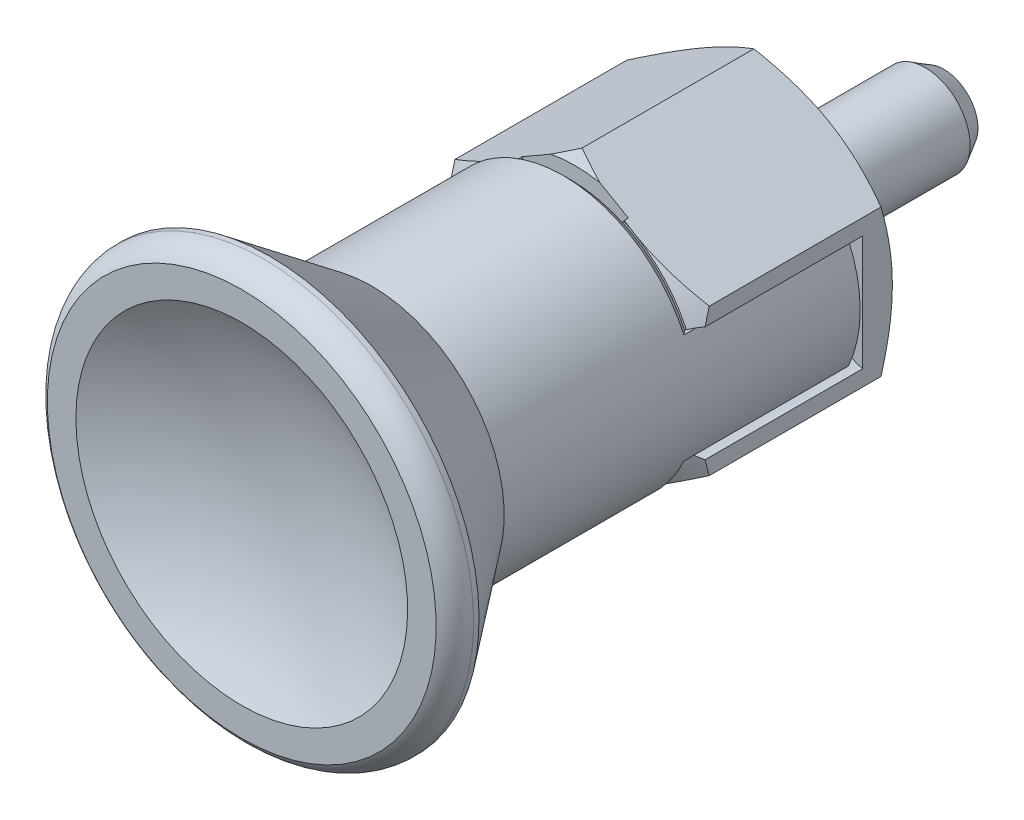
ISO-10303-21;
HEADER;
FILE_DESCRIPTION(('STEP AP214'),'2;1');
FILE_NAME('part.step','',(''),(''),'','','');
FILE_SCHEMA(('AUTOMOTIVE_DESIGN { 1 0 10303 214 1 1 1 1 }'));
ENDSEC;
DATA;
#1=APPLICATION_CONTEXT('core data for automotive mechanical design processes');
#2=APPLICATION_PROTOCOL_DEFINITION('international standard','automotive_design',2000,#1);
#3=PRODUCT_CONTEXT('',#1,'mechanical');
#4=PRODUCT('Part','Part','',(#3));
#5=PRODUCT_RELATED_PRODUCT_CATEGORY('part','',(#4));
#6=PRODUCT_DEFINITION_FORMATION('','',#4);
#7=PRODUCT_DEFINITION_CONTEXT('part definition',#1,'design');
#8=PRODUCT_DEFINITION('design','',#6,#7);
#9=PRODUCT_DEFINITION_SHAPE('','',#8);
#10=(LENGTH_UNIT() NAMED_UNIT(*) SI_UNIT(.MILLI.,.METRE.));
#11=(NAMED_UNIT(*) PLANE_ANGLE_UNIT() SI_UNIT($,.RADIAN.));
#12=(NAMED_UNIT(*) SI_UNIT($,.STERADIAN.) SOLID_ANGLE_UNIT());
#13=UNCERTAINTY_MEASURE_WITH_UNIT(LENGTH_MEASURE(1.E-05),#10,'distance_accuracy_value','');
#14=(GEOMETRIC_REPRESENTATION_CONTEXT(3) GLOBAL_UNCERTAINTY_ASSIGNED_CONTEXT((#13)) GLOBAL_UNIT_ASSIGNED_CONTEXT((#10,
#11,#12)) REPRESENTATION_CONTEXT('',''));
#15=CARTESIAN_POINT('',(0.,0.,0.));
#16=DIRECTION('',(0.,0.,1.));
#17=DIRECTION('',(1.,0.,0.));
#18=AXIS2_PLACEMENT_3D('',#15,#16,#17);
#19=CARTESIAN_POINT('',(-8.5,0.,0.));
#20=DIRECTION('',(0.,0.,1.));
#21=DIRECTION('',(0.,1.,0.));
#22=AXIS2_PLACEMENT_3D('',#19,#20,#21);
#23=PLANE('',#22);
#24=CARTESIAN_POINT('',(0.,0.,0.));
#25=DIRECTION('',(0.,0.,1.));
#26=DIRECTION('',(1.,0.,0.));
#27=AXIS2_PLACEMENT_3D('',#24,#25,#26);
#28=CIRCLE('',#27,8.5);
#29=CARTESIAN_POINT('',(-4.25,7.36121593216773,0.));
#30=VERTEX_POINT('',#29);
#31=CARTESIAN_POINT('',(-8.5,0.,0.));
#32=VERTEX_POINT('',#31);
#33=EDGE_CURVE('E244',#30,#32,#28,.T.);
#34=ORIENTED_EDGE('',*,*,#33,.F.);
#35=CARTESIAN_POINT('',(0.,0.,0.));
#36=DIRECTION('',(0.,0.,1.));
#37=DIRECTION('',(1.,0.,0.));
#38=AXIS2_PLACEMENT_3D('',#35,#36,#37);
#39=CIRCLE('',#38,8.5);
#40=CARTESIAN_POINT('',(4.25,7.36121593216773,0.));
#41=VERTEX_POINT('',#40);
#42=EDGE_CURVE('E237',#41,#30,#39,.T.);
#43=ORIENTED_EDGE('',*,*,#42,.F.);
#44=CARTESIAN_POINT('',(0.,0.,0.));
#45=DIRECTION('',(0.,0.,1.));
#46=DIRECTION('',(1.,0.,0.));
#47=AXIS2_PLACEMENT_3D('',#44,#45,#46);
#48=CIRCLE('',#47,8.5);
#49=CARTESIAN_POINT('',(8.5,0.,0.));
#50=VERTEX_POINT('',#49);
#51=EDGE_CURVE('E241',#50,#41,#48,.T.);
#52=ORIENTED_EDGE('',*,*,#51,.F.);
#53=CARTESIAN_POINT('',(0.,0.,0.));
#54=DIRECTION('',(0.,0.,1.));
#55=DIRECTION('',(0.,1.,0.));
#56=AXIS2_PLACEMENT_3D('',#53,#54,#55);
#57=CIRCLE('',#56,8.5);
#58=CARTESIAN_POINT('',(4.25,-7.36121593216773,0.));
#59=VERTEX_POINT('',#58);
#60=EDGE_CURVE('E267',#59,#50,#57,.T.);
#61=ORIENTED_EDGE('',*,*,#60,.F.);
#62=CARTESIAN_POINT('',(0.,0.,0.));
#63=DIRECTION('',(0.,0.,1.));
#64=DIRECTION('',(1.,0.,0.));
#65=AXIS2_PLACEMENT_3D('',#62,#63,#64);
#66=CIRCLE('',#65,8.5);
#67=CARTESIAN_POINT('',(-4.25,-7.36121593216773,0.));
#68=VERTEX_POINT('',#67);
#69=EDGE_CURVE('E268',#68,#59,#66,.T.);
#70=ORIENTED_EDGE('',*,*,#69,.F.);
#71=CARTESIAN_POINT('',(0.,0.,0.));
#72=DIRECTION('',(0.,0.,1.));
#73=DIRECTION('',(1.,0.,0.));
#74=AXIS2_PLACEMENT_3D('',#71,#72,#73);
#75=CIRCLE('',#74,8.5);
#76=EDGE_CURVE('E697',#32,#68,#75,.T.);
#77=ORIENTED_EDGE('',*,*,#76,.F.);
#78=EDGE_LOOP('',(#34,#43,#52,#61,#70,#77));
#79=FACE_BOUND('',#78,.T.);
#80=CARTESIAN_POINT('',(0.,0.,0.));
#81=DIRECTION('',(0.,0.,1.));
#82=DIRECTION('',(0.,1.,0.));
#83=AXIS2_PLACEMENT_3D('',#80,#81,#82);
#84=CIRCLE('',#83,5.);
#85=CARTESIAN_POINT('',(0.,5.,0.));
#86=VERTEX_POINT('',#85);
#87=EDGE_CURVE('E702',#86,#86,#84,.T.);
#88=ORIENTED_EDGE('',*,*,#87,.T.);
#89=EDGE_LOOP('',(#88));
#90=FACE_BOUND('',#89,.T.);
#91=ADVANCED_FACE('F14',(#79,#90),#23,.F.);
#92=CARTESIAN_POINT('',(0.,0.,0.763744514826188));
#93=DIRECTION('',(0.,0.,1.));
#94=DIRECTION('',(1.,0.,0.));
#95=AXIS2_PLACEMENT_3D('',#92,#93,#94);
#96=CONICAL_SURFACE('',#95,9.82284430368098,1.0471975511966);
#97=CARTESIAN_POINT('',(-4.25,7.36121593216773,0.));
#98=CARTESIAN_POINT('',(-4.06961134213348,7.46536337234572,-3.4739183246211E-05));
#99=CARTESIAN_POINT('',(-3.88923137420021,7.56950579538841,0.00441964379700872));
#100=CARTESIAN_POINT('',(-3.52882561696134,7.77758615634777,0.0220484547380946));
#101=CARTESIAN_POINT('',(-3.34879976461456,7.88152413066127,0.0352211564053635));
#102=CARTESIAN_POINT('',(-2.99026506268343,8.08852423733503,0.0699416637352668));
#103=CARTESIAN_POINT('',(-2.8117531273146,8.19158815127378,0.0914473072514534));
#104=CARTESIAN_POINT('',(-2.45557974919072,8.39722494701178,0.142371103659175));
#105=CARTESIAN_POINT('',(-2.27791832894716,8.49979781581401,0.171789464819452));
#106=CARTESIAN_POINT('',(-1.74694626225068,8.8063546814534,0.271004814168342));
#107=CARTESIAN_POINT('',(-1.39517810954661,9.00944811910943,0.351810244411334));
#108=CARTESIAN_POINT('',(-0.6946668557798,9.41388848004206,0.538168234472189));
#109=CARTESIAN_POINT('',(-0.345948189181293,9.61522129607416,0.643844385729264));
#110=CARTESIAN_POINT('',(0.,9.81495457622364,0.75918937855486));
#111=B_SPLINE_CURVE_WITH_KNOTS('',3,(#97,#98,#99,#100,#101,#102,#103,#104,#105,#106,#107,#108,
#109,#110),.UNSPECIFIED.,.F.,.F.,(4,2,2,2,2,2,4),(0.,0.624820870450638,1.24951805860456,
1.87109489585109,2.49268809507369,3.73424531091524,4.98210763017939),.UNSPECIFIED.);
#112=CARTESIAN_POINT('',(0.,9.81495457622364,0.759189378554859));
#113=VERTEX_POINT('',#112);
#114=EDGE_CURVE('E253',#30,#113,#111,.T.);
#115=ORIENTED_EDGE('',*,*,#114,.T.);
#116=CARTESIAN_POINT('',(0.,9.81495457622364,0.759189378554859));
#117=CARTESIAN_POINT('',(0.345948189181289,9.61522129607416,0.643844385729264));
#118=CARTESIAN_POINT('',(0.694666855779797,9.41388848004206,0.538168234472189));
#119=CARTESIAN_POINT('',(1.39517810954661,9.00944811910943,0.351810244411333));
#120=CARTESIAN_POINT('',(1.74694626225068,8.8063546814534,0.271004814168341));
#121=CARTESIAN_POINT('',(2.27791832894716,8.49979781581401,0.171789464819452));
#122=CARTESIAN_POINT('',(2.45557974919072,8.39722494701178,0.142371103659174));
#123=CARTESIAN_POINT('',(2.8117531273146,8.19158815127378,0.0914473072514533));
#124=CARTESIAN_POINT('',(2.99026506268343,8.08852423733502,0.0699416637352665));
#125=CARTESIAN_POINT('',(3.34879976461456,7.88152413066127,0.0352211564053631));
#126=CARTESIAN_POINT('',(3.52882561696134,7.77758615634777,0.0220484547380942));
#127=CARTESIAN_POINT('',(3.88923137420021,7.56950579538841,0.00441964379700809));
#128=CARTESIAN_POINT('',(4.06961134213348,7.46536337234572,-3.47391832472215E-05));
#129=CARTESIAN_POINT('',(4.25,7.36121593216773,0.));
#130=B_SPLINE_CURVE_WITH_KNOTS('',3,(#116,#117,#118,#119,#120,#121,#122,#123,#124,#125,#126,
#127,#128,#129),.UNSPECIFIED.,.F.,.F.,(4,2,2,2,2,2,4),(0.,1.24786231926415,2.48941953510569,
3.1110127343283,3.73258957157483,4.35728675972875,4.98210763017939),.UNSPECIFIED.);
#131=EDGE_CURVE('E251',#113,#41,#130,.T.);
#132=ORIENTED_EDGE('',*,*,#131,.T.);
#133=ORIENTED_EDGE('',*,*,#42,.T.);
#134=EDGE_LOOP('',(#115,#132,#133));
#135=FACE_BOUND('',#134,.T.);
#136=ADVANCED_FACE('F252',(#135),#96,.T.);
#137=CARTESIAN_POINT('',(0.,0.,12.2380554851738));
#138=DIRECTION('',(0.,0.,-1.));
#139=DIRECTION('',(0.,-1.,0.));
#140=AXIS2_PLACEMENT_3D('',#137,#138,#139);
#141=CONICAL_SURFACE('',#140,9.81972661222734,1.0471975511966);
#142=CARTESIAN_POINT('',(1.63703342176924,8.86981288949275,12.7));
#143=CARTESIAN_POINT('',(1.4991031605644,8.94944696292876,12.6692410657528));
#144=CARTESIAN_POINT('',(1.36152854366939,9.02887570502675,12.6363965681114));
#145=CARTESIAN_POINT('',(1.08718200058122,9.18726975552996,12.5668641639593));
#146=CARTESIAN_POINT('',(0.950409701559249,9.26623527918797,12.5301782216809));
#147=CARTESIAN_POINT('',(0.677627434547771,9.42372619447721,12.4532611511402));
#148=CARTESIAN_POINT('',(0.541617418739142,9.5022516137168,12.4130302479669));
#149=CARTESIAN_POINT('',(0.270279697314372,9.65890852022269,12.3292968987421));
#150=CARTESIAN_POINT('',(0.134952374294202,9.7370397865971,12.2857927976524));
#151=CARTESIAN_POINT('',(0.,9.81495457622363,12.2408106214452));
#152=B_SPLINE_CURVE_WITH_KNOTS('',3,(#142,#143,#144,#145,#146,#147,#148,#149,#150,#151),
.UNSPECIFIED.,.F.,.F.,(4,2,2,2,4),(0.,0.486608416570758,0.972969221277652,1.45929916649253,
1.94587669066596),.UNSPECIFIED.);
#153=CARTESIAN_POINT('',(1.63703342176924,8.86981288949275,12.7));
#154=VERTEX_POINT('',#153);
#155=CARTESIAN_POINT('',(0.,9.81495457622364,12.2408106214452));
#156=VERTEX_POINT('',#155);
#157=EDGE_CURVE('E259',#154,#156,#152,.T.);
#158=ORIENTED_EDGE('',*,*,#157,.T.);
#159=CARTESIAN_POINT('',(0.,9.81495457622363,12.2408106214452));
#160=CARTESIAN_POINT('',(-0.134952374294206,9.7370397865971,12.2857927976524));
#161=CARTESIAN_POINT('',(-0.270279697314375,9.65890852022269,12.3292968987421));
#162=CARTESIAN_POINT('',(-0.541617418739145,9.5022516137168,12.4130302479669));
#163=CARTESIAN_POINT('',(-0.677627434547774,9.42372619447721,12.4532611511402));
#164=CARTESIAN_POINT('',(-0.950409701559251,9.26623527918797,12.5301782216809));
#165=CARTESIAN_POINT('',(-1.08718200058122,9.18726975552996,12.5668641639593));
#166=CARTESIAN_POINT('',(-1.3615285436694,9.02887570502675,12.6363965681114));
#167=CARTESIAN_POINT('',(-1.4991031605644,8.94944696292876,12.6692410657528));
#168=CARTESIAN_POINT('',(-1.63703342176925,8.86981288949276,12.7));
#169=B_SPLINE_CURVE_WITH_KNOTS('',3,(#159,#160,#161,#162,#163,#164,#165,#166,#167,#168),
.UNSPECIFIED.,.F.,.F.,(4,2,2,2,4),(0.,0.486577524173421,0.972907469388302,1.45926827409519,
1.94587669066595),.UNSPECIFIED.);
#170=CARTESIAN_POINT('',(-1.63703342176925,8.86981288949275,12.7));
#171=VERTEX_POINT('',#170);
#172=EDGE_CURVE('E477',#156,#171,#169,.T.);
#173=ORIENTED_EDGE('',*,*,#172,.T.);
#174=CARTESIAN_POINT('',(0.,0.,12.7));
#175=DIRECTION('',(0.,0.,-1.));
#176=DIRECTION('',(0.,-1.,0.));
#177=AXIS2_PLACEMENT_3D('',#174,#175,#176);
#178=CIRCLE('',#177,9.01961524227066);
#179=EDGE_CURVE('E483',#154,#171,#178,.F.);
#180=ORIENTED_EDGE('',*,*,#179,.F.);
#181=EDGE_LOOP('',(#158,#173,#180));
#182=FACE_BOUND('',#181,.T.);
#183=ADVANCED_FACE('F637',(#182),#141,.T.);
#184=CARTESIAN_POINT('',(0.,0.,0.763744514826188));
#185=DIRECTION('',(0.,0.,1.));
#186=DIRECTION('',(1.,0.,0.));
#187=AXIS2_PLACEMENT_3D('',#184,#185,#186);
#188=CONICAL_SURFACE('',#187,9.82284430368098,1.0471975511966);
#189=CARTESIAN_POINT('',(-8.5,0.,0.));
#190=CARTESIAN_POINT('',(-8.5,0.208294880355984,-3.47391832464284E-05));
#191=CARTESIAN_POINT('',(-8.5,0.416579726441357,0.0044196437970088));
#192=CARTESIAN_POINT('',(-8.5,0.832740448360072,0.0220484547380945));
#193=CARTESIAN_POINT('',(-8.5,1.04061639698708,0.035221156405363));
#194=CARTESIAN_POINT('',(-8.5,1.4546166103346,0.0699416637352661));
#195=CARTESIAN_POINT('',(-8.5,1.66074443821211,0.091447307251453));
#196=CARTESIAN_POINT('',(-8.5,2.07201802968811,0.142371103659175));
#197=CARTESIAN_POINT('',(-8.5,2.27716376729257,0.171789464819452));
#198=CARTESIAN_POINT('',(-8.5,2.89027749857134,0.271004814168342));
#199=CARTESIAN_POINT('',(-8.5,3.2964643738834,0.351810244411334));
#200=CARTESIAN_POINT('',(-8.5,4.10534509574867,0.538168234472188));
#201=CARTESIAN_POINT('',(-8.5,4.50801072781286,0.643844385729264));
#202=CARTESIAN_POINT('',(-8.5,4.90747728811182,0.75918937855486));
#203=B_SPLINE_CURVE_WITH_KNOTS('',3,(#189,#190,#191,#192,#193,#194,#195,#196,#197,#198,#199,
#200,#201,#202),.UNSPECIFIED.,.F.,.F.,(4,2,2,2,2,2,4),(0.,0.624820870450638,1.24951805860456,
1.87109489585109,2.4926880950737,3.73424531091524,4.98210763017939),.UNSPECIFIED.);
#204=CARTESIAN_POINT('',(-8.5,4.90747728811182,0.759189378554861));
#205=VERTEX_POINT('',#204);
#206=EDGE_CURVE('E462',#32,#205,#203,.T.);
#207=ORIENTED_EDGE('',*,*,#206,.T.);
#208=CARTESIAN_POINT('',(-8.5,4.90747728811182,0.759189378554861));
#209=CARTESIAN_POINT('',(-8.15405181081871,5.1072105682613,0.643844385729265));
#210=CARTESIAN_POINT('',(-7.8053331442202,5.3085433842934,0.53816823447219));
#211=CARTESIAN_POINT('',(-7.10482189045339,5.71298374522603,0.351810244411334));
#212=CARTESIAN_POINT('',(-6.75305373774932,5.91607718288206,0.271004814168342));
#213=CARTESIAN_POINT('',(-6.22208167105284,6.22263404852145,0.171789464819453));
#214=CARTESIAN_POINT('',(-6.04442025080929,6.32520691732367,0.142371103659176));
#215=CARTESIAN_POINT('',(-5.6882468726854,6.53084371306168,0.0914473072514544));
#216=CARTESIAN_POINT('',(-5.50973493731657,6.63390762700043,0.0699416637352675));
#217=CARTESIAN_POINT('',(-5.15120023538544,6.84090773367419,0.0352211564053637));
#218=CARTESIAN_POINT('',(-4.97117438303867,6.94484570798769,0.0220484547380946));
#219=CARTESIAN_POINT('',(-4.61076862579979,7.15292606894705,0.00441964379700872));
#220=CARTESIAN_POINT('',(-4.43038865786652,7.25706849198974,-3.47391832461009E-05));
#221=CARTESIAN_POINT('',(-4.25,7.36121593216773,0.));
#222=B_SPLINE_CURVE_WITH_KNOTS('',3,(#208,#209,#210,#211,#212,#213,#214,#215,#216,#217,#218,
#219,#220,#221),.UNSPECIFIED.,.F.,.F.,(4,2,2,2,2,2,4),(0.,1.24786231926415,2.48941953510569,
3.1110127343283,3.73258957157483,4.35728675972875,4.98210763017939),.UNSPECIFIED.);
#223=EDGE_CURVE('E615',#205,#30,#222,.T.);
#224=ORIENTED_EDGE('',*,*,#223,.T.);
#225=ORIENTED_EDGE('',*,*,#33,.T.);
#226=EDGE_LOOP('',(#207,#224,#225));
#227=FACE_BOUND('',#226,.T.);
#228=ADVANCED_FACE('F631',(#227),#188,.T.);
#229=CARTESIAN_POINT('',(0.,0.,0.763744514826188));
#230=DIRECTION('',(0.,0.,1.));
#231=DIRECTION('',(1.,0.,0.));
#232=AXIS2_PLACEMENT_3D('',#229,#230,#231);
#233=CONICAL_SURFACE('',#232,9.82284430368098,1.0471975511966);
#234=CARTESIAN_POINT('',(-4.25,-7.36121593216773,0.));
#235=CARTESIAN_POINT('',(-4.43038865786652,-7.25706849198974,-3.47391832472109E-05));
#236=CARTESIAN_POINT('',(-4.61076862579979,-7.15292606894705,0.00441964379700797));
#237=CARTESIAN_POINT('',(-4.97117438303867,-6.94484570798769,0.0220484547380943));
#238=CARTESIAN_POINT('',(-5.15120023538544,-6.84090773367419,0.0352211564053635));
#239=CARTESIAN_POINT('',(-5.50973493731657,-6.63390762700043,0.0699416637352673));
#240=CARTESIAN_POINT('',(-5.6882468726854,-6.53084371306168,0.091447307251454));
#241=CARTESIAN_POINT('',(-6.04442025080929,-6.32520691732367,0.142371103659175));
#242=CARTESIAN_POINT('',(-6.22208167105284,-6.22263404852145,0.171789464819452));
#243=CARTESIAN_POINT('',(-6.75305373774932,-5.91607718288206,0.271004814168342));
#244=CARTESIAN_POINT('',(-7.10482189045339,-5.71298374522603,0.351810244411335));
#245=CARTESIAN_POINT('',(-7.8053331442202,-5.3085433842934,0.53816823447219));
#246=CARTESIAN_POINT('',(-8.15405181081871,-5.1072105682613,0.643844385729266));
#247=CARTESIAN_POINT('',(-8.5,-4.90747728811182,0.75918937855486));
#248=B_SPLINE_CURVE_WITH_KNOTS('',3,(#234,#235,#236,#237,#238,#239,#240,#241,#242,#243,#244,
#245,#246,#247),.UNSPECIFIED.,.F.,.F.,(4,2,2,2,2,2,4),(0.,0.624820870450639,1.24951805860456,
1.87109489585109,2.4926880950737,3.73424531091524,4.98210763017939),.UNSPECIFIED.);
#249=CARTESIAN_POINT('',(-8.5,-4.90747728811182,0.759189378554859));
#250=VERTEX_POINT('',#249);
#251=EDGE_CURVE('E453',#68,#250,#248,.T.);
#252=ORIENTED_EDGE('',*,*,#251,.T.);
#253=CARTESIAN_POINT('',(-8.5,-4.90747728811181,0.75918937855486));
#254=CARTESIAN_POINT('',(-8.5,-4.50801072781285,0.643844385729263));
#255=CARTESIAN_POINT('',(-8.5,-4.10534509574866,0.538168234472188));
#256=CARTESIAN_POINT('',(-8.5,-3.2964643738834,0.351810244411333));
#257=CARTESIAN_POINT('',(-8.5,-2.89027749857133,0.271004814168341));
#258=CARTESIAN_POINT('',(-8.5,-2.27716376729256,0.171789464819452));
#259=CARTESIAN_POINT('',(-8.5,-2.07201802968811,0.142371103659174));
#260=CARTESIAN_POINT('',(-8.5,-1.66074443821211,0.0914473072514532));
#261=CARTESIAN_POINT('',(-8.5,-1.45461661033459,0.0699416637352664));
#262=CARTESIAN_POINT('',(-8.5,-1.04061639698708,0.0352211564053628));
#263=CARTESIAN_POINT('',(-8.5,-0.83274044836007,0.0220484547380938));
#264=CARTESIAN_POINT('',(-8.5,-0.416579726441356,0.00441964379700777));
#265=CARTESIAN_POINT('',(-8.5,-0.208294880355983,-3.47391832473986E-05));
#266=CARTESIAN_POINT('',(-8.5,0.,0.));
#267=B_SPLINE_CURVE_WITH_KNOTS('',3,(#253,#254,#255,#256,#257,#258,#259,#260,#261,#262,#263,
#264,#265,#266),.UNSPECIFIED.,.F.,.F.,(4,2,2,2,2,2,4),(0.,1.24786231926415,2.48941953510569,
3.1110127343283,3.73258957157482,4.35728675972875,4.98210763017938),.UNSPECIFIED.);
#268=EDGE_CURVE('E648',#250,#32,#267,.T.);
#269=ORIENTED_EDGE('',*,*,#268,.T.);
#270=ORIENTED_EDGE('',*,*,#76,.T.);
#271=EDGE_LOOP('',(#252,#269,#270));
#272=FACE_BOUND('',#271,.T.);
#273=ADVANCED_FACE('F636',(#272),#233,.T.);
#274=CARTESIAN_POINT('',(0.,0.,0.763744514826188));
#275=DIRECTION('',(0.,0.,1.));
#276=DIRECTION('',(1.,0.,0.));
#277=AXIS2_PLACEMENT_3D('',#274,#275,#276);
#278=CONICAL_SURFACE('',#277,9.82284430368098,1.0471975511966);
#279=CARTESIAN_POINT('',(4.25,-7.36121593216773,0.));
#280=CARTESIAN_POINT('',(4.06961134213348,-7.46536337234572,-3.47391832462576E-05));
#281=CARTESIAN_POINT('',(3.88923137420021,-7.56950579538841,0.0044196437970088));
#282=CARTESIAN_POINT('',(3.52882561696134,-7.77758615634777,0.0220484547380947));
#283=CARTESIAN_POINT('',(3.34879976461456,-7.88152413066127,0.0352211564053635));
#284=CARTESIAN_POINT('',(2.99026506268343,-8.08852423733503,0.0699416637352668));
#285=CARTESIAN_POINT('',(2.8117531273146,-8.19158815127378,0.0914473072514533));
#286=CARTESIAN_POINT('',(2.45557974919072,-8.39722494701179,0.142371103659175));
#287=CARTESIAN_POINT('',(2.27791832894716,-8.49979781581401,0.171789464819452));
#288=CARTESIAN_POINT('',(1.74694626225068,-8.8063546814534,0.271004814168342));
#289=CARTESIAN_POINT('',(1.39517810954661,-9.00944811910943,0.351810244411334));
#290=CARTESIAN_POINT('',(0.694666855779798,-9.41388848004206,0.538168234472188));
#291=CARTESIAN_POINT('',(0.345948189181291,-9.61522129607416,0.643844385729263));
#292=CARTESIAN_POINT('',(0.,-9.81495457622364,0.75918937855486));
#293=B_SPLINE_CURVE_WITH_KNOTS('',3,(#279,#280,#281,#282,#283,#284,#285,#286,#287,#288,#289,
#290,#291,#292),.UNSPECIFIED.,.F.,.F.,(4,2,2,2,2,2,4),(0.,0.624820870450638,1.24951805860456,
1.87109489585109,2.49268809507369,3.73424531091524,4.98210763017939),.UNSPECIFIED.);
#294=CARTESIAN_POINT('',(0.,-9.81495457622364,0.759189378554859));
#295=VERTEX_POINT('',#294);
#296=EDGE_CURVE('E442',#59,#295,#293,.T.);
#297=ORIENTED_EDGE('',*,*,#296,.T.);
#298=CARTESIAN_POINT('',(0.,-9.81495457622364,0.759189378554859));
#299=CARTESIAN_POINT('',(-0.34594818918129,-9.61522129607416,0.643844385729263));
#300=CARTESIAN_POINT('',(-0.694666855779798,-9.41388848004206,0.538168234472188));
#301=CARTESIAN_POINT('',(-1.39517810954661,-9.00944811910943,0.351810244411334));
#302=CARTESIAN_POINT('',(-1.74694626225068,-8.8063546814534,0.271004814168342));
#303=CARTESIAN_POINT('',(-2.27791832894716,-8.49979781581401,0.171789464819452));
#304=CARTESIAN_POINT('',(-2.45557974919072,-8.39722494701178,0.142371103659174));
#305=CARTESIAN_POINT('',(-2.8117531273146,-8.19158815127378,0.0914473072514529));
#306=CARTESIAN_POINT('',(-2.99026506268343,-8.08852423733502,0.0699416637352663));
#307=CARTESIAN_POINT('',(-3.34879976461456,-7.88152413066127,0.0352211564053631));
#308=CARTESIAN_POINT('',(-3.52882561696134,-7.77758615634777,0.0220484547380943));
#309=CARTESIAN_POINT('',(-3.88923137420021,-7.56950579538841,0.00441964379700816));
#310=CARTESIAN_POINT('',(-4.06961134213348,-7.46536337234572,-3.47391832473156E-05));
#311=CARTESIAN_POINT('',(-4.25,-7.36121593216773,0.));
#312=B_SPLINE_CURVE_WITH_KNOTS('',3,(#298,#299,#300,#301,#302,#303,#304,#305,#306,#307,#308,
#309,#310,#311),.UNSPECIFIED.,.F.,.F.,(4,2,2,2,2,2,4),(0.,1.24786231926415,2.48941953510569,
3.1110127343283,3.73258957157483,4.35728675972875,4.98210763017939),.UNSPECIFIED.);
#313=EDGE_CURVE('E880',#295,#68,#312,.T.);
#314=ORIENTED_EDGE('',*,*,#313,.T.);
#315=ORIENTED_EDGE('',*,*,#69,.T.);
#316=EDGE_LOOP('',(#297,#314,#315));
#317=FACE_BOUND('',#316,.T.);
#318=ADVANCED_FACE('F888',(#317),#278,.T.);
#319=CARTESIAN_POINT('',(0.,0.,12.2380554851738));
#320=DIRECTION('',(0.,0.,-1.));
#321=DIRECTION('',(0.,-1.,0.));
#322=AXIS2_PLACEMENT_3D('',#319,#320,#321);
#323=CONICAL_SURFACE('',#322,9.81972661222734,1.0471975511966);
#324=CARTESIAN_POINT('',(-1.63703342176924,-8.86981288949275,12.7));
#325=CARTESIAN_POINT('',(-1.4991031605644,-8.94944696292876,12.6692410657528));
#326=CARTESIAN_POINT('',(-1.36152854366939,-9.02887570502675,12.6363965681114));
#327=CARTESIAN_POINT('',(-1.08718200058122,-9.18726975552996,12.5668641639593));
#328=CARTESIAN_POINT('',(-0.950409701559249,-9.26623527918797,12.5301782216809));
#329=CARTESIAN_POINT('',(-0.677627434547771,-9.42372619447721,12.4532611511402));
#330=CARTESIAN_POINT('',(-0.541617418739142,-9.5022516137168,12.4130302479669));
#331=CARTESIAN_POINT('',(-0.270279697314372,-9.65890852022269,12.3292968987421));
#332=CARTESIAN_POINT('',(-0.134952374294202,-9.7370397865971,12.2857927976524));
#333=CARTESIAN_POINT('',(0.,-9.81495457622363,12.2408106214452));
#334=B_SPLINE_CURVE_WITH_KNOTS('',3,(#324,#325,#326,#327,#328,#329,#330,#331,#332,#333),
.UNSPECIFIED.,.F.,.F.,(4,2,2,2,4),(0.,0.486608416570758,0.972969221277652,1.45929916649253,
1.94587669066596),.UNSPECIFIED.);
#335=CARTESIAN_POINT('',(-1.63703342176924,-8.86981288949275,12.7));
#336=VERTEX_POINT('',#335);
#337=CARTESIAN_POINT('',(0.,-9.81495457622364,12.2408106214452));
#338=VERTEX_POINT('',#337);
#339=EDGE_CURVE('E468',#336,#338,#334,.T.);
#340=ORIENTED_EDGE('',*,*,#339,.T.);
#341=CARTESIAN_POINT('',(0.,-9.81495457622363,12.2408106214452));
#342=CARTESIAN_POINT('',(0.134952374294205,-9.7370397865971,12.2857927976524));
#343=CARTESIAN_POINT('',(0.270279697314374,-9.65890852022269,12.3292968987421));
#344=CARTESIAN_POINT('',(0.541617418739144,-9.5022516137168,12.4130302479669));
#345=CARTESIAN_POINT('',(0.677627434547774,-9.42372619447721,12.4532611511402));
#346=CARTESIAN_POINT('',(0.950409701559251,-9.26623527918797,12.5301782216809));
#347=CARTESIAN_POINT('',(1.08718200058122,-9.18726975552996,12.5668641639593));
#348=CARTESIAN_POINT('',(1.3615285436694,-9.02887570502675,12.6363965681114));
#349=CARTESIAN_POINT('',(1.4991031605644,-8.94944696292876,12.6692410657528));
#350=CARTESIAN_POINT('',(1.63703342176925,-8.86981288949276,12.7));
#351=B_SPLINE_CURVE_WITH_KNOTS('',3,(#341,#342,#343,#344,#345,#346,#347,#348,#349,#350),
.UNSPECIFIED.,.F.,.F.,(4,2,2,2,4),(0.,0.486577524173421,0.972907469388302,1.4592682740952,
1.94587669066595),.UNSPECIFIED.);
#352=CARTESIAN_POINT('',(1.63703342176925,-8.86981288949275,12.7));
#353=VERTEX_POINT('',#352);
#354=EDGE_CURVE('E438',#338,#353,#351,.T.);
#355=ORIENTED_EDGE('',*,*,#354,.T.);
#356=CARTESIAN_POINT('',(0.,0.,12.7));
#357=DIRECTION('',(0.,0.,-1.));
#358=DIRECTION('',(0.,-1.,0.));
#359=AXIS2_PLACEMENT_3D('',#356,#357,#358);
#360=CIRCLE('',#359,9.01961524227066);
#361=EDGE_CURVE('E446',#336,#353,#360,.F.);
#362=ORIENTED_EDGE('',*,*,#361,.F.);
#363=EDGE_LOOP('',(#340,#355,#362));
#364=FACE_BOUND('',#363,.T.);
#365=ADVANCED_FACE('F304',(#364),#323,.T.);
#366=CARTESIAN_POINT('',(0.,0.,0.763744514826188));
#367=DIRECTION('',(0.,0.,1.));
#368=DIRECTION('',(1.,0.,0.));
#369=AXIS2_PLACEMENT_3D('',#366,#367,#368);
#370=CONICAL_SURFACE('',#369,9.82284430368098,1.0471975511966);
#371=CARTESIAN_POINT('',(4.25,7.36121593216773,0.));
#372=CARTESIAN_POINT('',(4.43038865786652,7.25706849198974,-3.47391832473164E-05));
#373=CARTESIAN_POINT('',(4.61076862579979,7.15292606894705,0.00441964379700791));
#374=CARTESIAN_POINT('',(4.97117438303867,6.94484570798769,0.0220484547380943));
#375=CARTESIAN_POINT('',(5.15120023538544,6.84090773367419,0.0352211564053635));
#376=CARTESIAN_POINT('',(5.50973493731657,6.63390762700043,0.0699416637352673));
#377=CARTESIAN_POINT('',(5.6882468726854,6.53084371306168,0.091447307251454));
#378=CARTESIAN_POINT('',(6.04442025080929,6.32520691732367,0.142371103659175));
#379=CARTESIAN_POINT('',(6.22208167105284,6.22263404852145,0.171789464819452));
#380=CARTESIAN_POINT('',(6.75305373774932,5.91607718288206,0.271004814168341));
#381=CARTESIAN_POINT('',(7.10482189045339,5.71298374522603,0.351810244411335));
#382=CARTESIAN_POINT('',(7.8053331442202,5.3085433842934,0.53816823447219));
#383=CARTESIAN_POINT('',(8.15405181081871,5.1072105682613,0.643844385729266));
#384=CARTESIAN_POINT('',(8.5,4.90747728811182,0.75918937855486));
#385=B_SPLINE_CURVE_WITH_KNOTS('',3,(#371,#372,#373,#374,#375,#376,#377,#378,#379,#380,#381,
#382,#383,#384),.UNSPECIFIED.,.F.,.F.,(4,2,2,2,2,2,4),(0.,0.624820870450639,1.24951805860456,
1.87109489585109,2.4926880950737,3.73424531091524,4.98210763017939),.UNSPECIFIED.);
#386=CARTESIAN_POINT('',(8.5,4.90747728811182,0.75918937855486));
#387=VERTEX_POINT('',#386);
#388=EDGE_CURVE('E258',#41,#387,#385,.T.);
#389=ORIENTED_EDGE('',*,*,#388,.T.);
#390=CARTESIAN_POINT('',(8.5,4.90747728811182,0.75918937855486));
#391=CARTESIAN_POINT('',(8.5,4.50801072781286,0.643844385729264));
#392=CARTESIAN_POINT('',(8.5,4.10534509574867,0.538168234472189));
#393=CARTESIAN_POINT('',(8.5,3.2964643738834,0.351810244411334));
#394=CARTESIAN_POINT('',(8.5,2.89027749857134,0.271004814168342));
#395=CARTESIAN_POINT('',(8.5,2.27716376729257,0.171789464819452));
#396=CARTESIAN_POINT('',(8.5,2.07201802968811,0.142371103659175));
#397=CARTESIAN_POINT('',(8.5,1.66074443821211,0.0914473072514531));
#398=CARTESIAN_POINT('',(8.5,1.4546166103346,0.0699416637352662));
#399=CARTESIAN_POINT('',(8.5,1.04061639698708,0.035221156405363));
#400=CARTESIAN_POINT('',(8.5,0.832740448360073,0.0220484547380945));
#401=CARTESIAN_POINT('',(8.5,0.416579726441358,0.00441964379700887));
#402=CARTESIAN_POINT('',(8.5,0.208294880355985,-3.47391832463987E-05));
#403=CARTESIAN_POINT('',(8.5,0.,0.));
#404=B_SPLINE_CURVE_WITH_KNOTS('',3,(#390,#391,#392,#393,#394,#395,#396,#397,#398,#399,#400,
#401,#402,#403),.UNSPECIFIED.,.F.,.F.,(4,2,2,2,2,2,4),(0.,1.24786231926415,2.4894195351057,
3.1110127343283,3.73258957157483,4.35728675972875,4.98210763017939),.UNSPECIFIED.);
#405=EDGE_CURVE('E265',#387,#50,#404,.T.);
#406=ORIENTED_EDGE('',*,*,#405,.T.);
#407=ORIENTED_EDGE('',*,*,#51,.T.);
#408=EDGE_LOOP('',(#389,#406,#407));
#409=FACE_BOUND('',#408,.T.);
#410=ADVANCED_FACE('F262',(#409),#370,.T.);
#411=CARTESIAN_POINT('',(0.,0.,0.763744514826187));
#412=DIRECTION('',(0.,0.,1.));
#413=DIRECTION('',(0.,1.,0.));
#414=AXIS2_PLACEMENT_3D('',#411,#412,#413);
#415=CONICAL_SURFACE('',#414,9.82284430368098,1.0471975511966);
#416=CARTESIAN_POINT('',(8.5,-4.90747728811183,0.759189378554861));
#417=CARTESIAN_POINT('',(8.15405181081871,-5.1072105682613,0.643844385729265));
#418=CARTESIAN_POINT('',(7.8053331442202,-5.3085433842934,0.538168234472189));
#419=CARTESIAN_POINT('',(7.10482189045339,-5.71298374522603,0.351810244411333));
#420=CARTESIAN_POINT('',(6.75305373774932,-5.91607718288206,0.271004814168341));
#421=CARTESIAN_POINT('',(6.22208167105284,-6.22263404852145,0.171789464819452));
#422=CARTESIAN_POINT('',(6.04442025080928,-6.32520691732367,0.142371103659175));
#423=CARTESIAN_POINT('',(5.6882468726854,-6.53084371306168,0.0914473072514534));
#424=CARTESIAN_POINT('',(5.50973493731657,-6.63390762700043,0.0699416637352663));
#425=CARTESIAN_POINT('',(5.15120023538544,-6.84090773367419,0.0352211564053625));
#426=CARTESIAN_POINT('',(4.97117438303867,-6.94484570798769,0.0220484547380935));
#427=CARTESIAN_POINT('',(4.61076862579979,-7.15292606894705,0.004419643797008));
#428=CARTESIAN_POINT('',(4.43038865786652,-7.25706849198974,-3.47391832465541E-05));
#429=CARTESIAN_POINT('',(4.25,-7.36121593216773,0.));
#430=B_SPLINE_CURVE_WITH_KNOTS('',3,(#416,#417,#418,#419,#420,#421,#422,#423,#424,#425,#426,
#427,#428,#429),.UNSPECIFIED.,.F.,.F.,(4,2,2,2,2,2,4),(0.,1.24786231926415,2.48941953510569,
3.1110127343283,3.73258957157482,4.35728675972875,4.98210763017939),.UNSPECIFIED.);
#431=CARTESIAN_POINT('',(8.5,-4.90747728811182,0.75918937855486));
#432=VERTEX_POINT('',#431);
#433=EDGE_CURVE('E813',#432,#59,#430,.T.);
#434=ORIENTED_EDGE('',*,*,#433,.T.);
#435=ORIENTED_EDGE('',*,*,#60,.T.);
#436=CARTESIAN_POINT('',(8.5,0.,0.));
#437=CARTESIAN_POINT('',(8.5,-0.208294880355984,-3.47391832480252E-05));
#438=CARTESIAN_POINT('',(8.5,-0.416579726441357,0.00441964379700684));
#439=CARTESIAN_POINT('',(8.5,-0.832740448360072,0.0220484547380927));
#440=CARTESIAN_POINT('',(8.5,-1.04061639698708,0.0352211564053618));
#441=CARTESIAN_POINT('',(8.5,-1.4546166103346,0.0699416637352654));
#442=CARTESIAN_POINT('',(8.5,-1.66074443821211,0.0914473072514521));
#443=CARTESIAN_POINT('',(8.5,-2.07201802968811,0.142371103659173));
#444=CARTESIAN_POINT('',(8.5,-2.27716376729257,0.171789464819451));
#445=CARTESIAN_POINT('',(8.5,-2.89027749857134,0.271004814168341));
#446=CARTESIAN_POINT('',(8.5,-3.2964643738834,0.351810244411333));
#447=CARTESIAN_POINT('',(8.5,-4.10534509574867,0.538168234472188));
#448=CARTESIAN_POINT('',(8.5,-4.50801072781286,0.643844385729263));
#449=CARTESIAN_POINT('',(8.5,-4.90747728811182,0.75918937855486));
#450=B_SPLINE_CURVE_WITH_KNOTS('',3,(#436,#437,#438,#439,#440,#441,#442,#443,#444,#445,#446,
#447,#448,#449),.UNSPECIFIED.,.F.,.F.,(4,2,2,2,2,2,4),(0.,0.624820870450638,1.24951805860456,
1.87109489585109,2.4926880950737,3.73424531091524,4.98210763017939),.UNSPECIFIED.);
#451=EDGE_CURVE('E317',#50,#432,#450,.T.);
#452=ORIENTED_EDGE('',*,*,#451,.T.);
#453=EDGE_LOOP('',(#434,#435,#452));
#454=FACE_BOUND('',#453,.T.);
#455=ADVANCED_FACE('F303',(#454),#415,.T.);
#456=CARTESIAN_POINT('',(0.,0.,54.));
#457=DIRECTION('',(1.,0.,0.));
#458=DIRECTION('',(0.,-1.,0.));
#459=AXIS2_PLACEMENT_3D('',#456,#457,#458);
#460=SPHERICAL_SURFACE('',#459,22.);
#461=CARTESIAN_POINT('',(0.,-11.0905365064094,35.));
#462=CARTESIAN_POINT('',(0.311592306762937,-11.0905387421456,35.));
#463=CARTESIAN_POINT('',(0.623147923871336,-11.0773996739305,35.));
#464=CARTESIAN_POINT('',(1.2441486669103,-11.0249351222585,35.));
#465=CARTESIAN_POINT('',(1.55359321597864,-10.9856027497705,35.));
#466=CARTESIAN_POINT('',(2.16839724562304,-10.8809650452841,35.));
#467=CARTESIAN_POINT('',(2.47375196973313,-10.8156317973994,35.));
#468=CARTESIAN_POINT('',(3.07786779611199,-10.6594588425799,35.));
#469=CARTESIAN_POINT('',(3.37662892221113,-10.5686192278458,35.));
#470=CARTESIAN_POINT('',(3.96528771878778,-10.3621299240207,35.));
#471=CARTESIAN_POINT('',(4.25518961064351,-10.2464922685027,35.));
#472=CARTESIAN_POINT('',(4.82422457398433,-9.99120122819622,35.));
#473=CARTESIAN_POINT('',(5.10335747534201,-9.85154746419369,35.));
#474=CARTESIAN_POINT('',(5.64879485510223,-9.54925716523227,35.));
#475=CARTESIAN_POINT('',(5.9151025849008,-9.38662649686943,35.));
#476=CARTESIAN_POINT('',(6.4330719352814,-9.03951216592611,35.));
#477=CARTESIAN_POINT('',(6.68473361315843,-8.85502858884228,35.));
#478=CARTESIAN_POINT('',(7.17164914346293,-8.46549844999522,35.));
#479=CARTESIAN_POINT('',(7.40690124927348,-8.26044970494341,35.));
#480=CARTESIAN_POINT('',(7.85929603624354,-7.83126308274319,35.));
#481=CARTESIAN_POINT('',(8.07643869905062,-7.60712518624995,35.));
#482=CARTESIAN_POINT('',(8.49107872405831,-7.14134478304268,35.));
#483=CARTESIAN_POINT('',(8.68857532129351,-6.89970159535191,35.));
#484=CARTESIAN_POINT('',(9.06250942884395,-6.40063637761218,35.));
#485=CARTESIAN_POINT('',(9.23894694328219,-6.14321435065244,35.));
#486=CARTESIAN_POINT('',(9.56950544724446,-5.61442651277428,35.));
#487=CARTESIAN_POINT('',(9.72362685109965,-5.34306096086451,35.));
#488=CARTESIAN_POINT('',(10.008461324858,-4.78831092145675,35.));
#489=CARTESIAN_POINT('',(10.1391743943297,-4.5049264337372,35.));
#490=CARTESIAN_POINT('',(10.3762626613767,-3.92815381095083,35.));
#491=CARTESIAN_POINT('',(10.4826379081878,-3.6347656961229,35.));
#492=CARTESIAN_POINT('',(10.6702946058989,-3.04007108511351,35.));
#493=CARTESIAN_POINT('',(10.7515760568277,-2.73876458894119,35.));
#494=CARTESIAN_POINT('',(10.8884674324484,-2.13037473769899,35.));
#495=CARTESIAN_POINT('',(10.9440773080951,-1.82329137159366,35.));
#496=CARTESIAN_POINT('',(11.0292299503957,-1.20553152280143,35.));
#497=CARTESIAN_POINT('',(11.0587727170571,-0.894855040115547,35.));
#498=CARTESIAN_POINT('',(11.0915810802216,-0.272118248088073,35.));
#499=CARTESIAN_POINT('',(11.0948467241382,0.039942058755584,35.));
#500=CARTESIAN_POINT('',(11.0750777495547,0.66322849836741,35.));
#501=CARTESIAN_POINT('',(11.0520431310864,0.974454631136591,35.));
#502=CARTESIAN_POINT('',(10.9798373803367,1.5938602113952,35.));
#503=CARTESIAN_POINT('',(10.9306662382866,1.90203965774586,35.));
#504=CARTESIAN_POINT('',(10.8065370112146,2.51316077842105,35.));
#505=CARTESIAN_POINT('',(10.7315789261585,2.81610245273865,35.));
#506=CARTESIAN_POINT('',(10.5564086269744,3.41459461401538,35.));
#507=CARTESIAN_POINT('',(10.4561963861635,3.71014509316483,35.));
#508=CARTESIAN_POINT('',(10.2312302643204,4.2917533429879,35.));
#509=CARTESIAN_POINT('',(10.1064763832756,4.57781111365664,35.));
#510=CARTESIAN_POINT('',(9.83331395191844,5.13840015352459,35.));
#511=CARTESIAN_POINT('',(9.68490540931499,5.41293142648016,35.));
#512=CARTESIAN_POINT('',(9.36548872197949,5.94851581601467,35.));
#513=CARTESIAN_POINT('',(9.19448057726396,6.20956893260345,35.));
#514=CARTESIAN_POINT('',(8.83108052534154,6.71634097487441,35.));
#515=CARTESIAN_POINT('',(8.63868862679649,6.96205990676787,35.));
#516=CARTESIAN_POINT('',(8.2338888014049,7.43641678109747,35.));
#517=CARTESIAN_POINT('',(8.02148087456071,7.66505472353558,35.));
#518=CARTESIAN_POINT('',(7.57815905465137,8.10362417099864,35.));
#519=CARTESIAN_POINT('',(7.34724515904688,8.3135556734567,35.));
#520=CARTESIAN_POINT('',(6.86855308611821,8.7132197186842,35.));
#521=CARTESIAN_POINT('',(6.62077490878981,8.90295226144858,35.));
#522=CARTESIAN_POINT('',(6.11011579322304,9.26086952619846,35.));
#523=CARTESIAN_POINT('',(5.84723485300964,9.4290542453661,35.));
#524=CARTESIAN_POINT('',(5.30823916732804,9.7426801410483,35.));
#525=CARTESIAN_POINT('',(5.03212442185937,9.88812131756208,35.));
#526=CARTESIAN_POINT('',(4.46862414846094,10.1552261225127,35.));
#527=CARTESIAN_POINT('',(4.18123862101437,10.276889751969,35.));
#528=CARTESIAN_POINT('',(3.59723991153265,10.4955745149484,35.));
#529=CARTESIAN_POINT('',(3.30062672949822,10.5925956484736,35.));
#530=CARTESIAN_POINT('',(2.70028146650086,10.7613056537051,35.));
#531=CARTESIAN_POINT('',(2.39654938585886,10.8329945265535,35.));
#532=CARTESIAN_POINT('',(1.78412566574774,10.9505303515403,35.));
#533=CARTESIAN_POINT('',(1.47543402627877,10.9963773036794,35.));
#534=CARTESIAN_POINT('',(0.855285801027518,11.0619033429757,35.));
#535=CARTESIAN_POINT('',(0.543829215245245,11.0815824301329,35.));
#536=CARTESIAN_POINT('',(-0.0796346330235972,11.0946328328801,35.));
#537=CARTESIAN_POINT('',(-0.391641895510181,11.0880041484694,35.));
#538=CARTESIAN_POINT('',(-1.01398892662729,11.0484861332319,35.));
#539=CARTESIAN_POINT('',(-1.32432869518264,11.0155968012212,35.));
#540=CARTESIAN_POINT('',(-1.94113439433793,10.9237913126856,35.));
#541=CARTESIAN_POINT('',(-2.24760032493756,10.8648751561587,35.));
#542=CARTESIAN_POINT('',(-2.85447957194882,10.7214348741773,35.));
#543=CARTESIAN_POINT('',(-3.15489288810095,10.6369107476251,35.));
#544=CARTESIAN_POINT('',(-3.74753113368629,10.4428554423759,35.));
#545=CARTESIAN_POINT('',(-4.03975606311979,10.3333242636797,35.));
#546=CARTESIAN_POINT('',(-4.61393995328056,10.0900335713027,35.));
#547=CARTESIAN_POINT('',(-4.89589891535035,9.95627406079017,35.));
#548=CARTESIAN_POINT('',(-5.44754635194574,9.66547764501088,35.));
#549=CARTESIAN_POINT('',(-5.71723482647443,9.50844073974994,35.));
#550=CARTESIAN_POINT('',(-6.24242392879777,9.17220599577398,35.));
#551=CARTESIAN_POINT('',(-6.49792455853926,8.99300816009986,35.));
#552=CARTESIAN_POINT('',(-6.99292155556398,8.61372552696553,35.));
#553=CARTESIAN_POINT('',(-7.23241792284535,8.41364072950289,35.));
#554=CARTESIAN_POINT('',(-7.69370381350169,7.99400657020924,35.));
#555=CARTESIAN_POINT('',(-7.91549332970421,7.77445720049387,35.));
#556=CARTESIAN_POINT('',(-8.33978861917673,7.31745483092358,35.));
#557=CARTESIAN_POINT('',(-8.54229439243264,7.08000183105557,35.));
#558=CARTESIAN_POINT('',(-8.92658256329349,6.58888027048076,35.));
#559=CARTESIAN_POINT('',(-9.10836495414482,6.33521170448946,35.));
#560=CARTESIAN_POINT('',(-9.44991391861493,5.81346251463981,35.));
#561=CARTESIAN_POINT('',(-9.60968049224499,5.54538189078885,35.));
#562=CARTESIAN_POINT('',(-9.90606181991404,4.99671476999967,35.));
#563=CARTESIAN_POINT('',(-10.0426765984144,4.71612828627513,35.));
#564=CARTESIAN_POINT('',(-10.2917832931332,4.14444398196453,35.));
#565=CARTESIAN_POINT('',(-10.4042752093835,3.85334616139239,35.));
#566=CARTESIAN_POINT('',(-10.6043363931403,3.26270882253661,35.));
#567=CARTESIAN_POINT('',(-10.6919056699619,2.96316930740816,35.));
#568=CARTESIAN_POINT('',(-10.8414990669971,2.35777801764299,35.));
#569=CARTESIAN_POINT('',(-10.9035231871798,2.05192624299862,35.));
#570=CARTESIAN_POINT('',(-11.0015854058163,1.43608429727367,35.));
#571=CARTESIAN_POINT('',(-11.0376234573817,1.12609411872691,35.));
#572=CARTESIAN_POINT('',(-11.083457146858,0.504179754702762,35.));
#573=CARTESIAN_POINT('',(-11.0932527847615,0.192255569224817,35.));
#574=CARTESIAN_POINT('',(-11.0865320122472,-0.431308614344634,35.));
#575=CARTESIAN_POINT('',(-11.0700156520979,-0.742948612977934,35.));
#576=CARTESIAN_POINT('',(-11.0107883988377,-1.36372945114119,35.));
#577=CARTESIAN_POINT('',(-10.9680775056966,-1.67287029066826,35.));
#578=CARTESIAN_POINT('',(-10.8567647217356,-2.2864556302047,35.));
#579=CARTESIAN_POINT('',(-10.7881627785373,-2.59090012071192,35.));
#580=CARTESIAN_POINT('',(-10.6255556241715,-3.19292769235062,35.));
#581=CARTESIAN_POINT('',(-10.5315504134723,-3.49051077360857,35.));
#582=CARTESIAN_POINT('',(-10.3188030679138,-4.07670533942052,35.));
#583=CARTESIAN_POINT('',(-10.2000604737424,-4.36531665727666,35.));
#584=CARTESIAN_POINT('',(-9.93868361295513,-4.93151003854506,35.));
#585=CARTESIAN_POINT('',(-9.79604934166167,-5.20909209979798,35.));
#586=CARTESIAN_POINT('',(-9.4879092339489,-5.75124282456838,35.));
#587=CARTESIAN_POINT('',(-9.32240428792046,-6.01581199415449,35.));
#588=CARTESIAN_POINT('',(-8.96969537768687,-6.53006740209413,35.));
#589=CARTESIAN_POINT('',(-8.78249143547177,-6.77975365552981,35.));
#590=CARTESIAN_POINT('',(-8.3877362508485,-7.26244279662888,35.));
#591=CARTESIAN_POINT('',(-8.18018717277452,-7.49544745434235,35.));
#592=CARTESIAN_POINT('',(-7.7461994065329,-7.94314738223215,35.));
#593=CARTESIAN_POINT('',(-7.51976064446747,-8.15784258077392,35.));
#594=CARTESIAN_POINT('',(-7.04954360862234,-8.56744885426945,35.));
#595=CARTESIAN_POINT('',(-6.80576092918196,-8.7623548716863,35.));
#596=CARTESIAN_POINT('',(-6.30264499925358,-9.13093141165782,35.));
#597=CARTESIAN_POINT('',(-6.04331199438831,-9.30460226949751,35.));
#598=CARTESIAN_POINT('',(-5.51080647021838,-9.62955592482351,35.));
#599=CARTESIAN_POINT('',(-5.23762730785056,-9.78082783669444,35.));
#600=CARTESIAN_POINT('',(-4.6794904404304,-10.0598066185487,35.));
#601=CARTESIAN_POINT('',(-4.39453269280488,-10.1875134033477,35.));
#602=CARTESIAN_POINT('',(-3.81517326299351,-10.4183286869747,35.));
#603=CARTESIAN_POINT('',(-3.5207820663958,-10.5214634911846,35.));
#604=CARTESIAN_POINT('',(-2.92445906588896,-10.7025527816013,35.));
#605=CARTESIAN_POINT('',(-2.62252926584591,-10.7805138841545,35.));
#606=CARTESIAN_POINT('',(-1.93727604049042,-10.9269540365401,35.));
#607=CARTESIAN_POINT('',(-1.55239554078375,-10.9882454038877,35.));
#608=CARTESIAN_POINT('',(-0.778324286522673,-11.0700352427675,35.));
#609=CARTESIAN_POINT('',(-0.389133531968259,-11.0905337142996,35.));
#610=CARTESIAN_POINT('',(0.,-11.0905365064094,35.));
#611=B_SPLINE_CURVE_WITH_KNOTS('',3,(#461,#462,#463,#464,#465,#466,#467,#468,#469,#470,#471,
#472,#473,#474,#475,#476,#477,#478,#479,#480,#481,#482,#483,#484,#485,#486,#487,#488,#489,#490,
#491,#492,#493,#494,#495,#496,#497,#498,#499,#500,#501,#502,#503,#504,#505,#506,#507,#508,#509,
#510,#511,#512,#513,#514,#515,#516,#517,#518,#519,#520,#521,#522,#523,#524,#525,#526,#527,#528,
#529,#530,#531,#532,#533,#534,#535,#536,#537,#538,#539,#540,#541,#542,#543,#544,#545,#546,#547,
#548,#549,#550,#551,#552,#553,#554,#555,#556,#557,#558,#559,#560,#561,#562,#563,#564,#565,#566,
#567,#568,#569,#570,#571,#572,#573,#574,#575,#576,#577,#578,#579,#580,#581,#582,#583,#584,#585,
#586,#587,#588,#589,#590,#591,#592,#593,#594,#595,#596,#597,#598,#599,#600,#601,#602,#603,#604,
#605,#606,#607,#608,#609,#610),.UNSPECIFIED.,.T.,.F.,(4,2,2,2,2,2,2,2,2,2,2,2,2,2,2,2,2,2,2,2,2,
2,2,2,2,2,2,2,2,2,2,2,2,2,2,2,2,2,2,2,2,2,2,2,2,2,2,2,2,2,2,2,2,2,2,2,2,2,2,2,2,2,2,2,2,2,2,2,2,
2,2,2,2,2,4),(0.,0.93443701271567,1.86911988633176,2.80480900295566,3.74049473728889,
4.67572744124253,5.61097491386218,6.54598402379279,7.48098947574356,8.41609429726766,
9.35120006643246,10.2863422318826,11.2214842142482,12.156608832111,13.0917334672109,
14.0268562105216,14.9619789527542,15.8971034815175,16.8322280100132,17.7673508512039,
18.7024736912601,19.637596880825,20.5727200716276,21.5078442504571,22.442968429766,
23.3780923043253,24.3132161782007,25.2483396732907,26.1834631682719,27.1185867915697,
28.053710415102,28.9888341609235,29.9239579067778,30.8590816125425,31.7942053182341,
32.7293289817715,33.6644526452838,34.599576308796,35.5346999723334,36.469823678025,
37.4049473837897,38.3400711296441,39.2751948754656,40.2103184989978,41.1454421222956,
42.0805656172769,43.0156891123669,43.9508129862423,44.8859368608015,45.8210610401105,
46.7561852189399,47.6913084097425,48.6264315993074,49.5615544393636,50.4966772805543,
51.4318018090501,52.3669263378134,53.3020490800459,54.2371718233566,55.1722964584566,
56.1074210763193,57.0425630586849,57.9777052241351,58.9128109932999,59.847915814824,
60.7829212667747,61.7179303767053,62.653177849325,63.5884105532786,64.5240962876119,
65.4597854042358,66.3944682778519,67.3289052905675,68.4958813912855,69.6628574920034),.UNSPECIFIED.);
#612=CARTESIAN_POINT('',(0.,-11.0905365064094,35.));
#613=VERTEX_POINT('',#612);
#614=EDGE_CURVE('E427',#613,#613,#611,.T.);
#615=ORIENTED_EDGE('',*,*,#614,.T.);
#616=EDGE_LOOP('',(#615));
#617=FACE_BOUND('',#616,.T.);
#618=ADVANCED_FACE('F488',(#617),#460,.F.);
#619=CARTESIAN_POINT('',(8.5,4.90747728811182,13.));
#620=DIRECTION('',(-0.5,-0.866025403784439,0.));
#621=DIRECTION('',(0.866025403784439,-0.5,0.));
#622=AXIS2_PLACEMENT_3D('',#619,#620,#621);
#623=PLANE('',#622);
#624=DIRECTION('',(0.,0.,1.));
#625=VECTOR('',#624,1.);
#626=CARTESIAN_POINT('',(3.55342622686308,7.76338298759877,13.));
#627=LINE('',#626,#625);
#628=CARTESIAN_POINT('',(3.55342622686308,7.76338298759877,12.9780772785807));
#629=VERTEX_POINT('',#628);
#630=CARTESIAN_POINT('',(3.55342622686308,7.76338298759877,12.7));
#631=VERTEX_POINT('',#630);
#632=EDGE_CURVE('E276',#629,#631,#627,.F.);
#633=ORIENTED_EDGE('',*,*,#632,.F.);
#634=CARTESIAN_POINT('',(4.25,7.36121593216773,13.));
#635=CARTESIAN_POINT('',(4.13381828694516,7.42829347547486,12.9999911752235));
#636=CARTESIAN_POINT('',(4.01767959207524,7.49534618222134,12.998159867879));
#637=CARTESIAN_POINT('',(3.78548833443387,7.62940186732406,12.990852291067));
#638=CARTESIAN_POINT('',(3.66943577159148,7.69640484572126,12.9853760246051));
#639=CARTESIAN_POINT('',(3.55342622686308,7.76338298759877,12.9780772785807));
#640=B_SPLINE_CURVE_WITH_KNOTS('',3,(#634,#635,#636,#637,#638,#639),.UNSPECIFIED.,.F.,.F.,(4,2,
4),(0.,0.402353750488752,0.804707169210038),.UNSPECIFIED.);
#641=CARTESIAN_POINT('',(4.25,7.36121593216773,13.));
#642=VERTEX_POINT('',#641);
#643=EDGE_CURVE('E274',#642,#629,#640,.T.);
#644=ORIENTED_EDGE('',*,*,#643,.F.);
#645=CARTESIAN_POINT('',(8.50000000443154,4.90747724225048,12.2408105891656));
#646=CARTESIAN_POINT('',(8.15405182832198,5.10721054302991,12.3561555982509));
#647=CARTESIAN_POINT('',(7.80533316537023,5.30854336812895,12.4618317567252));
#648=CARTESIAN_POINT('',(7.10482191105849,5.71298373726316,12.6481897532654));
#649=CARTESIAN_POINT('',(6.75305375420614,5.91607717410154,12.7289951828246));
#650=CARTESIAN_POINT('',(6.22208168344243,6.22263404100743,12.8282105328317));
#651=CARTESIAN_POINT('',(6.04442026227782,6.32520691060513,12.8576288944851));
#652=CARTESIAN_POINT('',(5.68824688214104,6.53084370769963,12.9085526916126));
#653=CARTESIAN_POINT('',(5.5097349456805,6.63390762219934,12.9300583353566));
#654=CARTESIAN_POINT('',(5.15120024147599,6.84090773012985,12.9647788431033));
#655=CARTESIAN_POINT('',(4.97117438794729,6.94484570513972,12.9779515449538));
#656=CARTESIAN_POINT('',(4.61076862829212,7.15292606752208,12.9955803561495));
#657=CARTESIAN_POINT('',(4.43038865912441,7.25706849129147,13.0000347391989));
#658=CARTESIAN_POINT('',(4.25,7.36121593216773,13.));
#659=B_SPLINE_CURVE_WITH_KNOTS('',3,(#645,#646,#647,#648,#649,#650,#651,#652,#653,#654,#655,
#656,#657,#658),.UNSPECIFIED.,.F.,.F.,(4,2,2,2,2,2,4),(0.,1.24786232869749,2.48941955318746,
3.11101275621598,3.73258959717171,4.35728678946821,4.98210766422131),.UNSPECIFIED.);
#660=CARTESIAN_POINT('',(8.50000001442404,4.9074772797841,12.2408106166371));
#661=VERTEX_POINT('',#660);
#662=EDGE_CURVE('E473',#661,#642,#659,.T.);
#663=ORIENTED_EDGE('',*,*,#662,.F.);
#664=DIRECTION('',(0.,0.,1.));
#665=VECTOR('',#664,1.);
#666=CARTESIAN_POINT('',(8.5,4.90747728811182,13.));
#667=LINE('',#666,#665);
#668=EDGE_CURVE('E273',#661,#387,#667,.F.);
#669=ORIENTED_EDGE('',*,*,#668,.T.);
#670=ORIENTED_EDGE('',*,*,#388,.F.);
#671=ORIENTED_EDGE('',*,*,#131,.F.);
#672=DIRECTION('',(0.,0.,1.));
#673=VECTOR('',#672,1.);
#674=CARTESIAN_POINT('',(0.,9.81495457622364,13.));
#675=LINE('',#674,#673);
#676=EDGE_CURVE('E478',#113,#156,#675,.T.);
#677=ORIENTED_EDGE('',*,*,#676,.T.);
#678=ORIENTED_EDGE('',*,*,#157,.F.);
#679=DIRECTION('',(-0.866025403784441,0.5,0.));
#680=VECTOR('',#679,1.);
#681=CARTESIAN_POINT('',(3.55342622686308,7.76338298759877,12.7));
#682=LINE('',#681,#680);
#683=EDGE_CURVE('E480',#631,#154,#682,.T.);
#684=ORIENTED_EDGE('',*,*,#683,.F.);
#685=EDGE_LOOP('',(#633,#644,#663,#669,#670,#671,#677,#678,#684));
#686=FACE_BOUND('',#685,.T.);
#687=ADVANCED_FACE('F271',(#686),#623,.F.);
#688=CARTESIAN_POINT('',(0.,0.,12.7));
#689=DIRECTION('',(0.,0.,1.));
#690=DIRECTION('',(0.,1.,0.));
#691=AXIS2_PLACEMENT_3D('',#688,#689,#690);
#692=PLANE('',#691);
#693=ORIENTED_EDGE('',*,*,#683,.T.);
#694=ORIENTED_EDGE('',*,*,#179,.T.);
#695=DIRECTION('',(0.866025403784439,0.5,0.));
#696=VECTOR('',#695,1.);
#697=CARTESIAN_POINT('',(0.,9.81495457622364,12.7));
#698=LINE('',#697,#696);
#699=CARTESIAN_POINT('',(-3.55342622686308,7.76338298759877,12.7));
#700=VERTEX_POINT('',#699);
#701=EDGE_CURVE('E474',#171,#700,#698,.F.);
#702=ORIENTED_EDGE('',*,*,#701,.T.);
#703=CARTESIAN_POINT('',(0.,9.6,12.7));
#704=DIRECTION('',(0.,0.,-1.));
#705=DIRECTION('',(0.,-1.,0.));
#706=AXIS2_PLACEMENT_3D('',#703,#704,#705);
#707=CIRCLE('',#706,4.);
#708=EDGE_CURVE('E472',#700,#631,#707,.F.);
#709=ORIENTED_EDGE('',*,*,#708,.T.);
#710=EDGE_LOOP('',(#693,#694,#702,#709));
#711=FACE_BOUND('',#710,.T.);
#712=ADVANCED_FACE('F679',(#711),#692,.T.);
#713=CARTESIAN_POINT('',(0.,9.81495457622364,13.));
#714=DIRECTION('',(0.5,-0.866025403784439,0.));
#715=DIRECTION('',(0.866025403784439,0.5,0.));
#716=AXIS2_PLACEMENT_3D('',#713,#714,#715);
#717=PLANE('',#716);
#718=DIRECTION('',(0.,0.,-1.));
#719=VECTOR('',#718,1.);
#720=CARTESIAN_POINT('',(-3.55342622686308,7.76338298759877,12.7));
#721=LINE('',#720,#719);
#722=CARTESIAN_POINT('',(-3.55342622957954,7.76338298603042,12.9780772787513));
#723=VERTEX_POINT('',#722);
#724=EDGE_CURVE('E469',#723,#700,#721,.T.);
#725=ORIENTED_EDGE('',*,*,#724,.T.);
#726=ORIENTED_EDGE('',*,*,#701,.F.);
#727=ORIENTED_EDGE('',*,*,#172,.F.);
#728=ORIENTED_EDGE('',*,*,#676,.F.);
#729=ORIENTED_EDGE('',*,*,#114,.F.);
#730=ORIENTED_EDGE('',*,*,#223,.F.);
#731=DIRECTION('',(0.,0.,1.));
#732=VECTOR('',#731,1.);
#733=CARTESIAN_POINT('',(-8.5,4.90747728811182,13.));
#734=LINE('',#733,#732);
#735=CARTESIAN_POINT('',(-8.5,4.90747724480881,12.2408106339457));
#736=VERTEX_POINT('',#735);
#737=EDGE_CURVE('E459',#205,#736,#734,.T.);
#738=ORIENTED_EDGE('',*,*,#737,.T.);
#739=CARTESIAN_POINT('',(-4.25,7.36121593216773,13.));
#740=CARTESIAN_POINT('',(-4.43038865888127,7.25706849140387,13.000034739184));
#741=CARTESIAN_POINT('',(-4.61076862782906,7.15292606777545,12.9955803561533));
#742=CARTESIAN_POINT('',(-4.97117438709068,6.94484570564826,12.9779515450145));
#743=CARTESIAN_POINT('',(-5.15120024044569,6.84090773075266,12.9647788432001));
#744=CARTESIAN_POINT('',(-5.50973494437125,6.63390762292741,12.9300583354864));
#745=CARTESIAN_POINT('',(-5.68824688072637,6.53084370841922,12.9085526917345));
#746=CARTESIAN_POINT('',(-6.04442026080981,6.32520691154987,12.8576288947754));
#747=CARTESIAN_POINT('',(-6.22208168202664,6.22263404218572,12.8282105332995));
#748=CARTESIAN_POINT('',(-6.75305375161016,5.9160771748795,12.7289951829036));
#749=CARTESIAN_POINT('',(-7.10482190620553,5.71298373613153,12.6481897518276));
#750=CARTESIAN_POINT('',(-7.80533316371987,5.30854337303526,12.4618317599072));
#751=CARTESIAN_POINT('',(-8.15405183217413,5.10721055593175,12.3561556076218));
#752=CARTESIAN_POINT('',(-8.50000002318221,4.90747727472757,12.2408106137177));
#753=B_SPLINE_CURVE_WITH_KNOTS('',3,(#739,#740,#741,#742,#743,#744,#745,#746,#747,#748,#749,
#750,#751,#752),.UNSPECIFIED.,.F.,.F.,(4,2,2,2,2,2,4),(0.,0.624820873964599,1.24951806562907,
1.87109490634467,2.49268810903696,3.73424533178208,4.98210765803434),.UNSPECIFIED.);
#754=CARTESIAN_POINT('',(-4.25,7.36121593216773,13.));
#755=VERTEX_POINT('',#754);
#756=EDGE_CURVE('E537',#755,#736,#753,.T.);
#757=ORIENTED_EDGE('',*,*,#756,.F.);
#758=CARTESIAN_POINT('',(-3.55342621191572,7.76338294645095,12.9780772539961));
#759=CARTESIAN_POINT('',(-3.66943576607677,7.69640482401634,12.985376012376));
#760=CARTESIAN_POINT('',(-3.7854883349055,7.62940185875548,12.9908522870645));
#761=CARTESIAN_POINT('',(-4.0176795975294,7.49534618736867,12.9981598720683));
#762=CARTESIAN_POINT('',(-4.13381829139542,7.42829348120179,12.9999911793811));
#763=CARTESIAN_POINT('',(-4.25,7.36121593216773,13.));
#764=B_SPLINE_CURVE_WITH_KNOTS('',3,(#758,#759,#760,#761,#762,#763),.UNSPECIFIED.,.F.,.F.,(4,2,
4),(0.,0.402353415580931,0.804707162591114),.UNSPECIFIED.);
#765=EDGE_CURVE('E476',#723,#755,#764,.T.);
#766=ORIENTED_EDGE('',*,*,#765,.F.);
#767=EDGE_LOOP('',(#725,#726,#727,#728,#729,#730,#738,#757,#766));
#768=FACE_BOUND('',#767,.T.);
#769=ADVANCED_FACE('F614',(#768),#717,.F.);
#770=CARTESIAN_POINT('',(0.,0.,2.));
#771=DIRECTION('',(0.,0.,1.));
#772=DIRECTION('',(0.,1.,0.));
#773=AXIS2_PLACEMENT_3D('',#770,#771,#772);
#774=PLANE('',#773);
#775=DIRECTION('',(0.,1.,0.));
#776=VECTOR('',#775,1.);
#777=CARTESIAN_POINT('',(-8.5,4.90747728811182,2.));
#778=LINE('',#777,#776);
#779=CARTESIAN_POINT('',(-8.5,3.84577690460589,2.));
#780=VERTEX_POINT('',#779);
#781=CARTESIAN_POINT('',(-8.5,-3.84577690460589,2.));
#782=VERTEX_POINT('',#781);
#783=EDGE_CURVE('E461',#780,#782,#778,.F.);
#784=ORIENTED_EDGE('',*,*,#783,.T.);
#785=CARTESIAN_POINT('',(-9.6,0.,2.));
#786=DIRECTION('',(0.,0.,-1.));
#787=DIRECTION('',(0.,-1.,0.));
#788=AXIS2_PLACEMENT_3D('',#785,#786,#787);
#789=CIRCLE('',#788,4.);
#790=EDGE_CURVE('E457',#782,#780,#789,.F.);
#791=ORIENTED_EDGE('',*,*,#790,.T.);
#792=EDGE_LOOP('',(#784,#791));
#793=FACE_BOUND('',#792,.T.);
#794=ADVANCED_FACE('F594',(#793),#774,.T.);
#795=CARTESIAN_POINT('',(-8.5,4.90747728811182,13.));
#796=DIRECTION('',(1.,0.,0.));
#797=DIRECTION('',(0.,1.,0.));
#798=AXIS2_PLACEMENT_3D('',#795,#796,#797);
#799=PLANE('',#798);
#800=DIRECTION('',(0.,0.,-1.));
#801=VECTOR('',#800,1.);
#802=CARTESIAN_POINT('',(-8.5,3.84577690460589,2.));
#803=LINE('',#802,#801);
#804=CARTESIAN_POINT('',(-8.5,3.84577690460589,12.5210746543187));
#805=VERTEX_POINT('',#804);
#806=EDGE_CURVE('E463',#780,#805,#803,.F.);
#807=ORIENTED_EDGE('',*,*,#806,.T.);
#808=CARTESIAN_POINT('',(-8.5,4.90747720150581,12.2408106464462));
#809=CARTESIAN_POINT('',(-8.5,4.8195476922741,12.2661934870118));
#810=CARTESIAN_POINT('',(-8.5,4.73148140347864,12.2911046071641));
#811=CARTESIAN_POINT('',(-8.5,4.55508578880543,12.3399280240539));
#812=CARTESIAN_POINT('',(-8.5,4.46675650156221,12.3638404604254));
#813=CARTESIAN_POINT('',(-8.5,4.28981981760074,12.4106185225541));
#814=CARTESIAN_POINT('',(-8.5,4.20121241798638,12.4334841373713));
#815=CARTESIAN_POINT('',(-8.5,4.02370840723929,12.4781173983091));
#816=CARTESIAN_POINT('',(-8.5,3.93481175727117,12.4998848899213));
#817=CARTESIAN_POINT('',(-8.5,3.84577690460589,12.5210746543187));
#818=B_SPLINE_CURVE_WITH_KNOTS('',3,(#808,#809,#810,#811,#812,#813,#814,#815,#816,#817),
.UNSPECIFIED.,.F.,.F.,(4,2,2,2,4),(0.,0.27455914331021,0.549079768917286,0.823603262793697,
1.09816527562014),.UNSPECIFIED.);
#819=EDGE_CURVE('E530',#736,#805,#818,.T.);
#820=ORIENTED_EDGE('',*,*,#819,.F.);
#821=ORIENTED_EDGE('',*,*,#737,.F.);
#822=ORIENTED_EDGE('',*,*,#206,.F.);
#823=ORIENTED_EDGE('',*,*,#268,.F.);
#824=DIRECTION('',(0.,0.,1.));
#825=VECTOR('',#824,1.);
#826=CARTESIAN_POINT('',(-8.5,-4.90747728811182,13.));
#827=LINE('',#826,#825);
#828=CARTESIAN_POINT('',(-8.5,-4.90747728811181,12.2408106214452));
#829=VERTEX_POINT('',#828);
#830=EDGE_CURVE('E450',#250,#829,#827,.T.);
#831=ORIENTED_EDGE('',*,*,#830,.T.);
#832=CARTESIAN_POINT('',(-8.5,-3.84577687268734,12.5210746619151));
#833=CARTESIAN_POINT('',(-8.5,-3.93481173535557,12.499884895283));
#834=CARTESIAN_POINT('',(-8.5,-4.0237083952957,12.4781174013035));
#835=CARTESIAN_POINT('',(-8.5,-4.20121242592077,12.433484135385));
#836=CARTESIAN_POINT('',(-8.5,-4.28981983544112,12.4106185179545));
#837=CARTESIAN_POINT('',(-8.5,-4.46675653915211,12.3638404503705));
#838=CARTESIAN_POINT('',(-8.5,-4.55508583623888,12.3399280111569));
#839=CARTESIAN_POINT('',(-8.5,-4.73148147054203,12.2911045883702));
#840=CARTESIAN_POINT('',(-8.5,-4.81954776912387,12.2661934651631));
#841=CARTESIAN_POINT('',(-8.5,-4.90747728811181,12.2408106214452));
#842=B_SPLINE_CURVE_WITH_KNOTS('',3,(#832,#833,#834,#835,#836,#837,#838,#839,#840,#841),
.UNSPECIFIED.,.F.,.F.,(4,2,2,2,4),(0.,0.274562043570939,0.549085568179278,0.823606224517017,
1.09816539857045),.UNSPECIFIED.);
#843=CARTESIAN_POINT('',(-8.5,-3.84577688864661,12.5210746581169));
#844=VERTEX_POINT('',#843);
#845=EDGE_CURVE('E660',#844,#829,#842,.T.);
#846=ORIENTED_EDGE('',*,*,#845,.F.);
#847=DIRECTION('',(0.,0.,-1.));
#848=VECTOR('',#847,1.);
#849=CARTESIAN_POINT('',(-8.5,-3.84577690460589,2.));
#850=LINE('',#849,#848);
#851=EDGE_CURVE('E454',#844,#782,#850,.T.);
#852=ORIENTED_EDGE('',*,*,#851,.T.);
#853=ORIENTED_EDGE('',*,*,#783,.F.);
#854=EDGE_LOOP('',(#807,#820,#821,#822,#823,#831,#846,#852,#853));
#855=FACE_BOUND('',#854,.T.);
#856=ADVANCED_FACE('F544',(#855),#799,.F.);
#857=CARTESIAN_POINT('',(-8.5,-4.90747728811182,13.));
#858=DIRECTION('',(0.5,0.866025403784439,0.));
#859=DIRECTION('',(-0.866025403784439,0.5,0.));
#860=AXIS2_PLACEMENT_3D('',#857,#858,#859);
#861=PLANE('',#860);
#862=DIRECTION('',(0.,0.,1.));
#863=VECTOR('',#862,1.);
#864=CARTESIAN_POINT('',(-3.55342622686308,-7.76338298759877,13.));
#865=LINE('',#864,#863);
#866=CARTESIAN_POINT('',(-3.55342622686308,-7.76338298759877,12.9780772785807));
#867=VERTEX_POINT('',#866);
#868=CARTESIAN_POINT('',(-3.55342622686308,-7.76338298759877,12.7));
#869=VERTEX_POINT('',#868);
#870=EDGE_CURVE('E447',#867,#869,#865,.F.);
#871=ORIENTED_EDGE('',*,*,#870,.F.);
#872=CARTESIAN_POINT('',(-4.25,-7.36121593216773,13.));
#873=CARTESIAN_POINT('',(-4.13381828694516,-7.42829347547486,12.9999911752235));
#874=CARTESIAN_POINT('',(-4.01767959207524,-7.49534618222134,12.998159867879));
#875=CARTESIAN_POINT('',(-3.78548833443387,-7.62940186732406,12.990852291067));
#876=CARTESIAN_POINT('',(-3.66943577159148,-7.69640484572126,12.9853760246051));
#877=CARTESIAN_POINT('',(-3.55342622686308,-7.76338298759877,12.9780772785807));
#878=B_SPLINE_CURVE_WITH_KNOTS('',3,(#872,#873,#874,#875,#876,#877),.UNSPECIFIED.,.F.,.F.,(4,2,
4),(0.,0.402353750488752,0.804707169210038),.UNSPECIFIED.);
#879=CARTESIAN_POINT('',(-4.25,-7.36121593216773,13.));
#880=VERTEX_POINT('',#879);
#881=EDGE_CURVE('E449',#880,#867,#878,.T.);
#882=ORIENTED_EDGE('',*,*,#881,.F.);
#883=CARTESIAN_POINT('',(-8.5,-4.90747728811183,12.2408106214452));
#884=CARTESIAN_POINT('',(-8.15405181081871,-5.10721056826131,12.3561556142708));
#885=CARTESIAN_POINT('',(-7.8053331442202,-5.3085433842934,12.4618317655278));
#886=CARTESIAN_POINT('',(-7.10482189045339,-5.71298374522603,12.6481897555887));
#887=CARTESIAN_POINT('',(-6.75305373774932,-5.91607718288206,12.7289951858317));
#888=CARTESIAN_POINT('',(-6.22208167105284,-6.22263404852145,12.8282105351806));
#889=CARTESIAN_POINT('',(-6.04442025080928,-6.32520691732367,12.8576288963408));
#890=CARTESIAN_POINT('',(-5.6882468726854,-6.53084371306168,12.9085526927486));
#891=CARTESIAN_POINT('',(-5.50973493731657,-6.63390762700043,12.9300583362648));
#892=CARTESIAN_POINT('',(-5.15120023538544,-6.84090773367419,12.9647788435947));
#893=CARTESIAN_POINT('',(-4.97117438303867,-6.94484570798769,12.9779515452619));
#894=CARTESIAN_POINT('',(-4.61076862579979,-7.15292606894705,12.995580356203));
#895=CARTESIAN_POINT('',(-4.43038865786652,-7.25706849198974,13.0000347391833));
#896=CARTESIAN_POINT('',(-4.25,-7.36121593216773,13.));
#897=B_SPLINE_CURVE_WITH_KNOTS('',3,(#883,#884,#885,#886,#887,#888,#889,#890,#891,#892,#893,
#894,#895,#896),.UNSPECIFIED.,.F.,.F.,(4,2,2,2,2,2,4),(0.,1.24786231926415,2.48941953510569,
3.1110127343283,3.73258957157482,4.35728675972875,4.98210763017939),.UNSPECIFIED.);
#898=EDGE_CURVE('E435',#829,#880,#897,.T.);
#899=ORIENTED_EDGE('',*,*,#898,.F.);
#900=ORIENTED_EDGE('',*,*,#830,.F.);
#901=ORIENTED_EDGE('',*,*,#251,.F.);
#902=ORIENTED_EDGE('',*,*,#313,.F.);
#903=DIRECTION('',(0.,0.,1.));
#904=VECTOR('',#903,1.);
#905=CARTESIAN_POINT('',(0.,-9.81495457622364,13.));
#906=LINE('',#905,#904);
#907=EDGE_CURVE('E439',#295,#338,#906,.T.);
#908=ORIENTED_EDGE('',*,*,#907,.T.);
#909=ORIENTED_EDGE('',*,*,#339,.F.);
#910=DIRECTION('',(0.866025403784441,-0.5,0.));
#911=VECTOR('',#910,1.);
#912=CARTESIAN_POINT('',(-3.55342622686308,-7.76338298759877,12.7));
#913=LINE('',#912,#911);
#914=EDGE_CURVE('E443',#869,#336,#913,.T.);
#915=ORIENTED_EDGE('',*,*,#914,.F.);
#916=EDGE_LOOP('',(#871,#882,#899,#900,#901,#902,#908,#909,#915));
#917=FACE_BOUND('',#916,.T.);
#918=ADVANCED_FACE('F874',(#917),#861,.F.);
#919=CARTESIAN_POINT('',(0.,0.,12.7));
#920=DIRECTION('',(0.,0.,1.));
#921=DIRECTION('',(0.,1.,0.));
#922=AXIS2_PLACEMENT_3D('',#919,#920,#921);
#923=PLANE('',#922);
#924=ORIENTED_EDGE('',*,*,#914,.T.);
#925=ORIENTED_EDGE('',*,*,#361,.T.);
#926=DIRECTION('',(-0.866025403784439,-0.5,0.));
#927=VECTOR('',#926,1.);
#928=CARTESIAN_POINT('',(0.,-9.81495457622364,12.7));
#929=LINE('',#928,#927);
#930=CARTESIAN_POINT('',(3.55342622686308,-7.76338298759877,12.7));
#931=VERTEX_POINT('',#930);
#932=EDGE_CURVE('E436',#353,#931,#929,.F.);
#933=ORIENTED_EDGE('',*,*,#932,.T.);
#934=CARTESIAN_POINT('',(0.,-9.6,12.7));
#935=DIRECTION('',(0.,0.,-1.));
#936=DIRECTION('',(0.,-1.,0.));
#937=AXIS2_PLACEMENT_3D('',#934,#935,#936);
#938=CIRCLE('',#937,4.);
#939=EDGE_CURVE('E434',#931,#869,#938,.F.);
#940=ORIENTED_EDGE('',*,*,#939,.T.);
#941=EDGE_LOOP('',(#924,#925,#933,#940));
#942=FACE_BOUND('',#941,.T.);
#943=ADVANCED_FACE('F832',(#942),#923,.T.);
#944=CARTESIAN_POINT('',(0.,-9.81495457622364,13.));
#945=DIRECTION('',(-0.5,0.866025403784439,0.));
#946=DIRECTION('',(-0.866025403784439,-0.5,0.));
#947=AXIS2_PLACEMENT_3D('',#944,#945,#946);
#948=PLANE('',#947);
#949=DIRECTION('',(0.,0.,-1.));
#950=VECTOR('',#949,1.);
#951=CARTESIAN_POINT('',(3.55342622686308,-7.76338298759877,12.7));
#952=LINE('',#951,#950);
#953=CARTESIAN_POINT('',(3.55342622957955,-7.76338298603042,12.9780772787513));
#954=VERTEX_POINT('',#953);
#955=EDGE_CURVE('E431',#954,#931,#952,.T.);
#956=ORIENTED_EDGE('',*,*,#955,.T.);
#957=ORIENTED_EDGE('',*,*,#932,.F.);
#958=ORIENTED_EDGE('',*,*,#354,.F.);
#959=ORIENTED_EDGE('',*,*,#907,.F.);
#960=ORIENTED_EDGE('',*,*,#296,.F.);
#961=ORIENTED_EDGE('',*,*,#433,.F.);
#962=DIRECTION('',(0.,0.,1.));
#963=VECTOR('',#962,1.);
#964=CARTESIAN_POINT('',(8.5,-4.90747728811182,13.));
#965=LINE('',#964,#963);
#966=CARTESIAN_POINT('',(8.5,-4.90747724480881,12.2408106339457));
#967=VERTEX_POINT('',#966);
#968=EDGE_CURVE('E417',#432,#967,#965,.T.);
#969=ORIENTED_EDGE('',*,*,#968,.T.);
#970=CARTESIAN_POINT('',(4.25,-7.36121593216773,13.));
#971=CARTESIAN_POINT('',(4.43038865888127,-7.25706849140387,13.000034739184));
#972=CARTESIAN_POINT('',(4.61076862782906,-7.15292606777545,12.9955803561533));
#973=CARTESIAN_POINT('',(4.97117438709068,-6.94484570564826,12.9779515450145));
#974=CARTESIAN_POINT('',(5.15120024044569,-6.84090773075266,12.9647788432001));
#975=CARTESIAN_POINT('',(5.50973494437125,-6.63390762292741,12.9300583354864));
#976=CARTESIAN_POINT('',(5.68824688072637,-6.53084370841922,12.9085526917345));
#977=CARTESIAN_POINT('',(6.04442026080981,-6.32520691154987,12.8576288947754));
#978=CARTESIAN_POINT('',(6.22208168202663,-6.22263404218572,12.8282105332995));
#979=CARTESIAN_POINT('',(6.75305375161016,-5.9160771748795,12.7289951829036));
#980=CARTESIAN_POINT('',(7.10482190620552,-5.71298373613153,12.6481897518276));
#981=CARTESIAN_POINT('',(7.80533316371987,-5.30854337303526,12.4618317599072));
#982=CARTESIAN_POINT('',(8.15405183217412,-5.10721055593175,12.3561556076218));
#983=CARTESIAN_POINT('',(8.5000000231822,-4.90747727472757,12.2408106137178));
#984=B_SPLINE_CURVE_WITH_KNOTS('',3,(#970,#971,#972,#973,#974,#975,#976,#977,#978,#979,#980,
#981,#982,#983),.UNSPECIFIED.,.F.,.F.,(4,2,2,2,2,2,4),(0.,0.624820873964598,1.24951806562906,
1.87109490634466,2.49268810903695,3.73424533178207,4.98210765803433),.UNSPECIFIED.);
#985=CARTESIAN_POINT('',(4.25,-7.36121593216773,13.));
#986=VERTEX_POINT('',#985);
#987=EDGE_CURVE('E360',#986,#967,#984,.T.);
#988=ORIENTED_EDGE('',*,*,#987,.F.);
#989=CARTESIAN_POINT('',(3.55342621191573,-7.76338294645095,12.9780772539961));
#990=CARTESIAN_POINT('',(3.66943576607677,-7.69640482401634,12.985376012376));
#991=CARTESIAN_POINT('',(3.78548833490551,-7.62940185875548,12.9908522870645));
#992=CARTESIAN_POINT('',(4.0176795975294,-7.49534618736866,12.9981598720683));
#993=CARTESIAN_POINT('',(4.13381829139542,-7.42829348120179,12.9999911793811));
#994=CARTESIAN_POINT('',(4.25,-7.36121593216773,13.));
#995=B_SPLINE_CURVE_WITH_KNOTS('',3,(#989,#990,#991,#992,#993,#994),.UNSPECIFIED.,.F.,.F.,(4,2,
4),(0.,0.402353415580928,0.804707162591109),.UNSPECIFIED.);
#996=EDGE_CURVE('E323',#954,#986,#995,.T.);
#997=ORIENTED_EDGE('',*,*,#996,.F.);
#998=EDGE_LOOP('',(#956,#957,#958,#959,#960,#961,#969,#988,#997));
#999=FACE_BOUND('',#998,.T.);
#1000=ADVANCED_FACE('F810',(#999),#948,.F.);
#1001=CARTESIAN_POINT('',(0.,0.,2.));
#1002=DIRECTION('',(0.,0.,1.));
#1003=DIRECTION('',(0.,1.,0.));
#1004=AXIS2_PLACEMENT_3D('',#1001,#1002,#1003);
#1005=PLANE('',#1004);
#1006=DIRECTION('',(0.,-1.,0.));
#1007=VECTOR('',#1006,1.);
#1008=CARTESIAN_POINT('',(8.5,-4.90747728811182,2.));
#1009=LINE('',#1008,#1007);
#1010=CARTESIAN_POINT('',(8.5,-3.84577690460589,2.));
#1011=VERTEX_POINT('',#1010);
#1012=CARTESIAN_POINT('',(8.5,3.84577690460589,2.));
#1013=VERTEX_POINT('',#1012);
#1014=EDGE_CURVE('E419',#1011,#1013,#1009,.F.);
#1015=ORIENTED_EDGE('',*,*,#1014,.T.);
#1016=CARTESIAN_POINT('',(9.6,0.,2.));
#1017=DIRECTION('',(0.,0.,-1.));
#1018=DIRECTION('',(0.,-1.,0.));
#1019=AXIS2_PLACEMENT_3D('',#1016,#1017,#1018);
#1020=CIRCLE('',#1019,4.);
#1021=EDGE_CURVE('E425',#1013,#1011,#1020,.F.);
#1022=ORIENTED_EDGE('',*,*,#1021,.T.);
#1023=EDGE_LOOP('',(#1015,#1022));
#1024=FACE_BOUND('',#1023,.T.);
#1025=ADVANCED_FACE('F337',(#1024),#1005,.T.);
#1026=CARTESIAN_POINT('',(8.5,-4.90747728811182,13.));
#1027=DIRECTION('',(-1.,0.,0.));
#1028=DIRECTION('',(0.,-1.,0.));
#1029=AXIS2_PLACEMENT_3D('',#1026,#1027,#1028);
#1030=PLANE('',#1029);
#1031=DIRECTION('',(0.,0.,-1.));
#1032=VECTOR('',#1031,1.);
#1033=CARTESIAN_POINT('',(8.5,-3.84577690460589,2.));
#1034=LINE('',#1033,#1032);
#1035=CARTESIAN_POINT('',(8.5,-3.84577690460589,12.5210746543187));
#1036=VERTEX_POINT('',#1035);
#1037=EDGE_CURVE('E421',#1011,#1036,#1034,.F.);
#1038=ORIENTED_EDGE('',*,*,#1037,.T.);
#1039=CARTESIAN_POINT('',(8.5,-4.90747720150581,12.2408106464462));
#1040=CARTESIAN_POINT('',(8.5,-4.8195476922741,12.2661934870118));
#1041=CARTESIAN_POINT('',(8.5,-4.73148140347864,12.2911046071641));
#1042=CARTESIAN_POINT('',(8.5,-4.55508578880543,12.3399280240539));
#1043=CARTESIAN_POINT('',(8.5,-4.46675650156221,12.3638404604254));
#1044=CARTESIAN_POINT('',(8.5,-4.28981981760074,12.4106185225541));
#1045=CARTESIAN_POINT('',(8.5,-4.20121241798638,12.4334841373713));
#1046=CARTESIAN_POINT('',(8.5,-4.02370840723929,12.4781173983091));
#1047=CARTESIAN_POINT('',(8.5,-3.93481175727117,12.4998848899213));
#1048=CARTESIAN_POINT('',(8.5,-3.84577690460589,12.5210746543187));
#1049=B_SPLINE_CURVE_WITH_KNOTS('',3,(#1039,#1040,#1041,#1042,#1043,#1044,#1045,#1046,#1047,
#1048),.UNSPECIFIED.,.F.,.F.,(4,2,2,2,4),(0.,0.27455914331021,0.549079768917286,
0.823603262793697,1.09816527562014),.UNSPECIFIED.);
#1050=EDGE_CURVE('E352',#967,#1036,#1049,.T.);
#1051=ORIENTED_EDGE('',*,*,#1050,.F.);
#1052=ORIENTED_EDGE('',*,*,#968,.F.);
#1053=ORIENTED_EDGE('',*,*,#451,.F.);
#1054=ORIENTED_EDGE('',*,*,#405,.F.);
#1055=ORIENTED_EDGE('',*,*,#668,.F.);
#1056=CARTESIAN_POINT('',(8.5,3.84577690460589,12.5210746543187));
#1057=CARTESIAN_POINT('',(8.5,3.93481175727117,12.4998848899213));
#1058=CARTESIAN_POINT('',(8.5,4.02370840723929,12.4781173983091));
#1059=CARTESIAN_POINT('',(8.5,4.20121241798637,12.4334841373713));
#1060=CARTESIAN_POINT('',(8.5,4.28981981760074,12.4106185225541));
#1061=CARTESIAN_POINT('',(8.5,4.4667565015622,12.3638404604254));
#1062=CARTESIAN_POINT('',(8.5,4.55508578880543,12.3399280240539));
#1063=CARTESIAN_POINT('',(8.5,4.73148140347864,12.2911046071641));
#1064=CARTESIAN_POINT('',(8.5,4.81954769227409,12.2661934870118));
#1065=CARTESIAN_POINT('',(8.5,4.9074772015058,12.2408106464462));
#1066=B_SPLINE_CURVE_WITH_KNOTS('',3,(#1056,#1057,#1058,#1059,#1060,#1061,#1062,#1063,#1064,
#1065),.UNSPECIFIED.,.F.,.F.,(4,2,2,2,4),(0.,0.274562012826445,0.549085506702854,
0.823606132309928,1.09816527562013),.UNSPECIFIED.);
#1067=CARTESIAN_POINT('',(8.5,3.84577690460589,12.5210746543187));
#1068=VERTEX_POINT('',#1067);
#1069=EDGE_CURVE('E344',#1068,#661,#1066,.T.);
#1070=ORIENTED_EDGE('',*,*,#1069,.F.);
#1071=DIRECTION('',(0.,0.,-1.));
#1072=VECTOR('',#1071,1.);
#1073=CARTESIAN_POINT('',(8.5,3.84577690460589,2.));
#1074=LINE('',#1073,#1072);
#1075=EDGE_CURVE('E428',#1068,#1013,#1074,.T.);
#1076=ORIENTED_EDGE('',*,*,#1075,.T.);
#1077=ORIENTED_EDGE('',*,*,#1014,.F.);
#1078=EDGE_LOOP('',(#1038,#1051,#1052,#1053,#1054,#1055,#1070,#1076,#1077));
#1079=FACE_BOUND('',#1078,.T.);
#1080=ADVANCED_FACE('F331',(#1079),#1030,.F.);
#1081=CARTESIAN_POINT('',(-11.0905365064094,0.,35.));
#1082=DIRECTION('',(0.,0.,-1.));
#1083=DIRECTION('',(0.,-1.,0.));
#1084=AXIS2_PLACEMENT_3D('',#1081,#1082,#1083);
#1085=PLANE('',#1084);
#1086=ORIENTED_EDGE('',*,*,#614,.F.);
#1087=EDGE_LOOP('',(#1086));
#1088=FACE_BOUND('',#1087,.T.);
#1089=CARTESIAN_POINT('',(0.,0.,35.));
#1090=DIRECTION('',(0.,0.,-1.));
#1091=DIRECTION('',(0.,-1.,0.));
#1092=AXIS2_PLACEMENT_3D('',#1089,#1090,#1091);
#1093=CIRCLE('',#1092,13.);
#1094=CARTESIAN_POINT('',(0.,-13.,35.));
#1095=VERTEX_POINT('',#1094);
#1096=EDGE_CURVE('E424',#1095,#1095,#1093,.T.);
#1097=ORIENTED_EDGE('',*,*,#1096,.F.);
#1098=EDGE_LOOP('',(#1097));
#1099=FACE_BOUND('',#1098,.T.);
#1100=ADVANCED_FACE('F336',(#1088,#1099),#1085,.F.);
#1101=CARTESIAN_POINT('',(0.,0.,12.2362554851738));
#1102=DIRECTION('',(0.,0.,-1.));
#1103=DIRECTION('',(0.,-1.,0.));
#1104=AXIS2_PLACEMENT_3D('',#1101,#1102,#1103);
#1105=CONICAL_SURFACE('',#1104,9.82284430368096,1.0471975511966);
#1106=ORIENTED_EDGE('',*,*,#1069,.T.);
#1107=ORIENTED_EDGE('',*,*,#662,.T.);
#1108=CARTESIAN_POINT('',(0.,0.,13.));
#1109=DIRECTION('',(0.,0.,-1.));
#1110=DIRECTION('',(0.,-1.,0.));
#1111=AXIS2_PLACEMENT_3D('',#1108,#1109,#1110);
#1112=CIRCLE('',#1111,8.5);
#1113=CARTESIAN_POINT('',(7.7296875,3.53580700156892,13.));
#1114=VERTEX_POINT('',#1113);
#1115=EDGE_CURVE('E792',#642,#1114,#1112,.T.);
#1116=ORIENTED_EDGE('',*,*,#1115,.T.);
#1117=CARTESIAN_POINT('',(7.7296875,3.53580700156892,13.));
#1118=CARTESIAN_POINT('',(7.85223445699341,3.60062755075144,12.9200776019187));
#1119=CARTESIAN_POINT('',(7.9780220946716,3.65901376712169,12.8400241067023));
#1120=CARTESIAN_POINT('',(8.17077336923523,3.73658996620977,12.720198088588));
#1121=CARTESIAN_POINT('',(8.23567665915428,3.76077421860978,12.6803135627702));
#1122=CARTESIAN_POINT('',(8.36686357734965,3.80581040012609,12.6006081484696));
#1123=CARTESIAN_POINT('',(8.43314974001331,3.82665546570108,12.5607875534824));
#1124=CARTESIAN_POINT('',(8.5,3.84577690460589,12.5210746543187));
#1125=B_SPLINE_CURVE_WITH_KNOTS('',3,(#1117,#1118,#1119,#1120,#1121,#1122,#1123,#1124),
.UNSPECIFIED.,.F.,.F.,(4,2,2,4),(0.,0.479765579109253,0.719466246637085,0.959653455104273),.UNSPECIFIED.);
#1126=EDGE_CURVE('E388',#1114,#1068,#1125,.T.);
#1127=ORIENTED_EDGE('',*,*,#1126,.T.);
#1128=EDGE_LOOP('',(#1106,#1107,#1116,#1127));
#1129=FACE_BOUND('',#1128,.T.);
#1130=ADVANCED_FACE('F508',(#1129),#1105,.T.);
#1131=CARTESIAN_POINT('',(0.,0.,12.9779457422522));
#1132=DIRECTION('',(0.,0.,-1.));
#1133=DIRECTION('',(-1.,0.,0.));
#1134=AXIS2_PLACEMENT_3D('',#1131,#1132,#1133);
#1135=CONICAL_SURFACE('',#1134,8.53819909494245,1.0471975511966);
#1136=CARTESIAN_POINT('',(3.55342622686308,7.76338298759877,12.9780772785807));
#1137=CARTESIAN_POINT('',(3.55051656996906,7.75775347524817,12.9817317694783));
#1138=CARTESIAN_POINT('',(3.54759347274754,7.75213076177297,12.9853859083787));
#1139=CARTESIAN_POINT('',(3.54172039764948,7.74089893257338,12.9926934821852));
#1140=CARTESIAN_POINT('',(3.53877041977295,7.73528981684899,12.9963469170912));
#1141=CARTESIAN_POINT('',(3.53580700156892,7.7296875,13.));
#1142=B_SPLINE_CURVE_WITH_KNOTS('',3,(#1136,#1137,#1138,#1139,#1140,#1141),.UNSPECIFIED.,.F.,
.F.,(4,2,4),(0.,0.0219455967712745,0.0438911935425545),.UNSPECIFIED.);
#1143=CARTESIAN_POINT('',(3.53580700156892,7.7296875,13.));
#1144=VERTEX_POINT('',#1143);
#1145=EDGE_CURVE('E522',#629,#1144,#1142,.T.);
#1146=ORIENTED_EDGE('',*,*,#1145,.T.);
#1147=CARTESIAN_POINT('',(0.,0.,13.));
#1148=DIRECTION('',(0.,0.,-1.));
#1149=DIRECTION('',(-1.,0.,0.));
#1150=AXIS2_PLACEMENT_3D('',#1147,#1148,#1149);
#1151=CIRCLE('',#1150,8.5);
#1152=EDGE_CURVE('E786',#1144,#642,#1151,.T.);
#1153=ORIENTED_EDGE('',*,*,#1152,.T.);
#1154=ORIENTED_EDGE('',*,*,#643,.T.);
#1155=EDGE_LOOP('',(#1146,#1153,#1154));
#1156=FACE_BOUND('',#1155,.T.);
#1157=ADVANCED_FACE('F511',(#1156),#1135,.T.);
#1158=CARTESIAN_POINT('',(0.,9.6,12.7));
#1159=DIRECTION('',(0.,0.,-1.));
#1160=DIRECTION('',(0.,-1.,0.));
#1161=AXIS2_PLACEMENT_3D('',#1158,#1159,#1160);
#1162=CYLINDRICAL_SURFACE('',#1161,4.);
#1163=CARTESIAN_POINT('',(0.,9.6,13.));
#1164=DIRECTION('',(0.,0.,-1.));
#1165=DIRECTION('',(0.,-1.,0.));
#1166=AXIS2_PLACEMENT_3D('',#1163,#1164,#1165);
#1167=CIRCLE('',#1166,4.);
#1168=CARTESIAN_POINT('',(-3.46297324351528,7.598046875,13.));
#1169=VERTEX_POINT('',#1168);
#1170=CARTESIAN_POINT('',(3.46297324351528,7.598046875,13.));
#1171=VERTEX_POINT('',#1170);
#1172=EDGE_CURVE('E784',#1169,#1171,#1167,.F.);
#1173=ORIENTED_EDGE('',*,*,#1172,.T.);
#1174=CARTESIAN_POINT('',(0.,9.6,13.));
#1175=DIRECTION('',(0.,0.,-1.));
#1176=DIRECTION('',(0.,-1.,0.));
#1177=AXIS2_PLACEMENT_3D('',#1174,#1175,#1176);
#1178=CIRCLE('',#1177,4.);
#1179=EDGE_CURVE('E788',#1171,#1144,#1178,.F.);
#1180=ORIENTED_EDGE('',*,*,#1179,.T.);
#1181=ORIENTED_EDGE('',*,*,#1145,.F.);
#1182=ORIENTED_EDGE('',*,*,#632,.T.);
#1183=ORIENTED_EDGE('',*,*,#708,.F.);
#1184=ORIENTED_EDGE('',*,*,#724,.F.);
#1185=CARTESIAN_POINT('',(-3.53580700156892,7.7296875,13.));
#1186=CARTESIAN_POINT('',(-3.53877041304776,7.73528980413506,12.9963469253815));
#1187=CARTESIAN_POINT('',(-3.54172038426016,7.74089890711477,12.9926934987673));
#1188=CARTESIAN_POINT('',(-3.54759344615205,7.75213071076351,12.9853859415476));
#1189=CARTESIAN_POINT('',(-3.55051653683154,7.75775341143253,12.9817318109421));
#1190=CARTESIAN_POINT('',(-3.55342618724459,7.76338291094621,12.9780773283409));
#1191=B_SPLINE_CURVE_WITH_KNOTS('',3,(#1185,#1186,#1187,#1188,#1189,#1190),.UNSPECIFIED.,.F.,
.F.,(4,2,4),(0.,0.0219455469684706,0.0438910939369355),.UNSPECIFIED.);
#1192=CARTESIAN_POINT('',(-3.53580700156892,7.7296875,13.));
#1193=VERTEX_POINT('',#1192);
#1194=EDGE_CURVE('E565',#1193,#723,#1191,.T.);
#1195=ORIENTED_EDGE('',*,*,#1194,.F.);
#1196=CARTESIAN_POINT('',(0.,9.6,13.));
#1197=DIRECTION('',(0.,0.,-1.));
#1198=DIRECTION('',(0.,-1.,0.));
#1199=AXIS2_PLACEMENT_3D('',#1196,#1197,#1198);
#1200=CIRCLE('',#1199,4.);
#1201=EDGE_CURVE('E528',#1169,#1193,#1200,.T.);
#1202=ORIENTED_EDGE('',*,*,#1201,.F.);
#1203=EDGE_LOOP('',(#1173,#1180,#1181,#1182,#1183,#1184,#1195,#1202));
#1204=FACE_BOUND('',#1203,.T.);
#1205=ADVANCED_FACE('F517',(#1204),#1162,.F.);
#1206=CARTESIAN_POINT('',(0.,0.,12.2362554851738));
#1207=DIRECTION('',(0.,0.,-1.));
#1208=DIRECTION('',(0.,-1.,0.));
#1209=AXIS2_PLACEMENT_3D('',#1206,#1207,#1208);
#1210=CONICAL_SURFACE('',#1209,9.82284430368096,1.0471975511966);
#1211=CARTESIAN_POINT('',(0.,0.,13.));
#1212=DIRECTION('',(0.,0.,-1.));
#1213=DIRECTION('',(0.,-1.,0.));
#1214=AXIS2_PLACEMENT_3D('',#1211,#1212,#1213);
#1215=CIRCLE('',#1214,8.5);
#1216=CARTESIAN_POINT('',(-7.7296875,3.53580700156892,13.));
#1217=VERTEX_POINT('',#1216);
#1218=EDGE_CURVE('E606',#1217,#755,#1215,.T.);
#1219=ORIENTED_EDGE('',*,*,#1218,.T.);
#1220=ORIENTED_EDGE('',*,*,#756,.T.);
#1221=ORIENTED_EDGE('',*,*,#819,.T.);
#1222=CARTESIAN_POINT('',(-8.5,3.84577690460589,12.5210746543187));
#1223=CARTESIAN_POINT('',(-8.43314974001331,3.82665546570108,12.5607875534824));
#1224=CARTESIAN_POINT('',(-8.36686357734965,3.80581040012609,12.6006081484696));
#1225=CARTESIAN_POINT('',(-8.23567665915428,3.76077421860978,12.6803135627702));
#1226=CARTESIAN_POINT('',(-8.17077336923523,3.73658996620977,12.720198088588));
#1227=CARTESIAN_POINT('',(-7.9780220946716,3.65901376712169,12.8400241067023));
#1228=CARTESIAN_POINT('',(-7.85223445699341,3.60062755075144,12.9200776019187));
#1229=CARTESIAN_POINT('',(-7.7296875,3.53580700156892,13.));
#1230=B_SPLINE_CURVE_WITH_KNOTS('',3,(#1222,#1223,#1224,#1225,#1226,#1227,#1228,#1229),
.UNSPECIFIED.,.F.,.F.,(4,2,2,4),(0.,0.240187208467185,0.479887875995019,0.959653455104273),.UNSPECIFIED.);
#1231=EDGE_CURVE('E559',#805,#1217,#1230,.T.);
#1232=ORIENTED_EDGE('',*,*,#1231,.T.);
#1233=EDGE_LOOP('',(#1219,#1220,#1221,#1232));
#1234=FACE_BOUND('',#1233,.T.);
#1235=ADVANCED_FACE('F548',(#1234),#1210,.T.);
#1236=CARTESIAN_POINT('',(0.,0.,12.977945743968));
#1237=DIRECTION('',(0.,0.,-1.));
#1238=DIRECTION('',(-1.,0.,0.));
#1239=AXIS2_PLACEMENT_3D('',#1236,#1237,#1238);
#1240=CONICAL_SURFACE('',#1239,8.53819909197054,1.0471975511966);
#1241=ORIENTED_EDGE('',*,*,#1194,.T.);
#1242=ORIENTED_EDGE('',*,*,#765,.T.);
#1243=CARTESIAN_POINT('',(0.,0.,13.));
#1244=DIRECTION('',(0.,0.,-1.));
#1245=DIRECTION('',(-1.,0.,0.));
#1246=AXIS2_PLACEMENT_3D('',#1243,#1244,#1245);
#1247=CIRCLE('',#1246,8.5);
#1248=EDGE_CURVE('E779',#755,#1193,#1247,.T.);
#1249=ORIENTED_EDGE('',*,*,#1248,.T.);
#1250=EDGE_LOOP('',(#1241,#1242,#1249));
#1251=FACE_BOUND('',#1250,.T.);
#1252=ADVANCED_FACE('F552',(#1251),#1240,.T.);
#1253=CARTESIAN_POINT('',(-9.6,0.,2.));
#1254=DIRECTION('',(0.,0.,-1.));
#1255=DIRECTION('',(0.,-1.,0.));
#1256=AXIS2_PLACEMENT_3D('',#1253,#1254,#1255);
#1257=CYLINDRICAL_SURFACE('',#1256,4.);
#1258=ORIENTED_EDGE('',*,*,#790,.F.);
#1259=ORIENTED_EDGE('',*,*,#851,.F.);
#1260=CARTESIAN_POINT('',(-7.7296875,-3.53580700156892,13.));
#1261=CARTESIAN_POINT('',(-7.85223444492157,-3.60062754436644,12.9200776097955));
#1262=CARTESIAN_POINT('',(-7.97802206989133,-3.65901375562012,12.840024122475));
#1263=CARTESIAN_POINT('',(-8.17077332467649,-3.73658994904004,12.7201981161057));
#1264=CARTESIAN_POINT('',(-8.23567660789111,-3.76077419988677,12.6803135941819));
#1265=CARTESIAN_POINT('',(-8.36686351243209,-3.80581037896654,12.6006081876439));
#1266=CARTESIAN_POINT('',(-8.43314966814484,-3.826655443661,12.560787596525));
#1267=CARTESIAN_POINT('',(-8.49999992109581,-3.84577688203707,12.5210747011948));
#1268=B_SPLINE_CURVE_WITH_KNOTS('',3,(#1260,#1261,#1262,#1263,#1264,#1265,#1266,#1267),
.UNSPECIFIED.,.F.,.F.,(4,2,2,4),(0.,0.479765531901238,0.719466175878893,0.959653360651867),.UNSPECIFIED.);
#1269=CARTESIAN_POINT('',(-7.7296875,-3.53580700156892,13.));
#1270=VERTEX_POINT('',#1269);
#1271=EDGE_CURVE('E466',#1270,#844,#1268,.T.);
#1272=ORIENTED_EDGE('',*,*,#1271,.F.);
#1273=CARTESIAN_POINT('',(-9.6,0.,13.));
#1274=DIRECTION('',(0.,0.,-1.));
#1275=DIRECTION('',(0.,-1.,0.));
#1276=AXIS2_PLACEMENT_3D('',#1273,#1274,#1275);
#1277=CIRCLE('',#1276,4.);
#1278=CARTESIAN_POINT('',(-7.598046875,-3.46297324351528,13.));
#1279=VERTEX_POINT('',#1278);
#1280=EDGE_CURVE('E458',#1279,#1270,#1277,.T.);
#1281=ORIENTED_EDGE('',*,*,#1280,.F.);
#1282=CARTESIAN_POINT('',(-9.6,0.,13.));
#1283=DIRECTION('',(0.,0.,-1.));
#1284=DIRECTION('',(0.,-1.,0.));
#1285=AXIS2_PLACEMENT_3D('',#1282,#1283,#1284);
#1286=CIRCLE('',#1285,4.);
#1287=CARTESIAN_POINT('',(-7.598046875,3.46297324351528,13.));
#1288=VERTEX_POINT('',#1287);
#1289=EDGE_CURVE('E775',#1279,#1288,#1286,.F.);
#1290=ORIENTED_EDGE('',*,*,#1289,.T.);
#1291=CARTESIAN_POINT('',(-9.6,0.,13.));
#1292=DIRECTION('',(0.,0.,-1.));
#1293=DIRECTION('',(0.,-1.,0.));
#1294=AXIS2_PLACEMENT_3D('',#1291,#1292,#1293);
#1295=CIRCLE('',#1294,4.);
#1296=EDGE_CURVE('E602',#1288,#1217,#1295,.F.);
#1297=ORIENTED_EDGE('',*,*,#1296,.T.);
#1298=ORIENTED_EDGE('',*,*,#1231,.F.);
#1299=ORIENTED_EDGE('',*,*,#806,.F.);
#1300=EDGE_LOOP('',(#1258,#1259,#1272,#1281,#1290,#1297,#1298,#1299));
#1301=FACE_BOUND('',#1300,.T.);
#1302=ADVANCED_FACE('F571',(#1301),#1257,.F.);
#1303=CARTESIAN_POINT('',(0.,0.,12.2362554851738));
#1304=DIRECTION('',(0.,0.,-1.));
#1305=DIRECTION('',(0.,-1.,0.));
#1306=AXIS2_PLACEMENT_3D('',#1303,#1304,#1305);
#1307=CONICAL_SURFACE('',#1306,9.82284430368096,1.0471975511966);
#1308=ORIENTED_EDGE('',*,*,#845,.T.);
#1309=ORIENTED_EDGE('',*,*,#898,.T.);
#1310=CARTESIAN_POINT('',(0.,0.,13.));
#1311=DIRECTION('',(0.,0.,-1.));
#1312=DIRECTION('',(0.,-1.,0.));
#1313=AXIS2_PLACEMENT_3D('',#1310,#1311,#1312);
#1314=CIRCLE('',#1313,8.5);
#1315=EDGE_CURVE('E772',#880,#1270,#1314,.T.);
#1316=ORIENTED_EDGE('',*,*,#1315,.T.);
#1317=ORIENTED_EDGE('',*,*,#1271,.T.);
#1318=EDGE_LOOP('',(#1308,#1309,#1316,#1317));
#1319=FACE_BOUND('',#1318,.T.);
#1320=ADVANCED_FACE('F575',(#1319),#1307,.T.);
#1321=CARTESIAN_POINT('',(0.,0.,12.9779457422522));
#1322=DIRECTION('',(0.,0.,-1.));
#1323=DIRECTION('',(-1.,0.,0.));
#1324=AXIS2_PLACEMENT_3D('',#1321,#1322,#1323);
#1325=CONICAL_SURFACE('',#1324,8.53819909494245,1.0471975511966);
#1326=CARTESIAN_POINT('',(-3.55342622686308,-7.76338298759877,12.9780772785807));
#1327=CARTESIAN_POINT('',(-3.55051656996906,-7.75775347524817,12.9817317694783));
#1328=CARTESIAN_POINT('',(-3.54759347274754,-7.75213076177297,12.9853859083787));
#1329=CARTESIAN_POINT('',(-3.54172039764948,-7.74089893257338,12.9926934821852));
#1330=CARTESIAN_POINT('',(-3.53877041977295,-7.73528981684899,12.9963469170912));
#1331=CARTESIAN_POINT('',(-3.53580700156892,-7.7296875,13.));
#1332=B_SPLINE_CURVE_WITH_KNOTS('',3,(#1326,#1327,#1328,#1329,#1330,#1331),.UNSPECIFIED.,.F.,
.F.,(4,2,4),(0.,0.0219455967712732,0.0438911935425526),.UNSPECIFIED.);
#1333=CARTESIAN_POINT('',(-3.53580700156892,-7.7296875,13.));
#1334=VERTEX_POINT('',#1333);
#1335=EDGE_CURVE('E855',#867,#1334,#1332,.T.);
#1336=ORIENTED_EDGE('',*,*,#1335,.T.);
#1337=CARTESIAN_POINT('',(0.,0.,13.));
#1338=DIRECTION('',(0.,0.,-1.));
#1339=DIRECTION('',(-1.,0.,0.));
#1340=AXIS2_PLACEMENT_3D('',#1337,#1338,#1339);
#1341=CIRCLE('',#1340,8.5);
#1342=EDGE_CURVE('E766',#1334,#880,#1341,.T.);
#1343=ORIENTED_EDGE('',*,*,#1342,.T.);
#1344=ORIENTED_EDGE('',*,*,#881,.T.);
#1345=EDGE_LOOP('',(#1336,#1343,#1344));
#1346=FACE_BOUND('',#1345,.T.);
#1347=ADVANCED_FACE('F860',(#1346),#1325,.T.);
#1348=CARTESIAN_POINT('',(0.,-9.6,12.7));
#1349=DIRECTION('',(0.,0.,-1.));
#1350=DIRECTION('',(0.,-1.,0.));
#1351=AXIS2_PLACEMENT_3D('',#1348,#1349,#1350);
#1352=CYLINDRICAL_SURFACE('',#1351,4.);
#1353=CARTESIAN_POINT('',(0.,-9.6,13.));
#1354=DIRECTION('',(0.,0.,-1.));
#1355=DIRECTION('',(0.,-1.,0.));
#1356=AXIS2_PLACEMENT_3D('',#1353,#1354,#1355);
#1357=CIRCLE('',#1356,4.);
#1358=CARTESIAN_POINT('',(3.46297324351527,-7.598046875,13.));
#1359=VERTEX_POINT('',#1358);
#1360=CARTESIAN_POINT('',(-3.46297324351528,-7.598046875,13.));
#1361=VERTEX_POINT('',#1360);
#1362=EDGE_CURVE('E764',#1359,#1361,#1357,.F.);
#1363=ORIENTED_EDGE('',*,*,#1362,.T.);
#1364=CARTESIAN_POINT('',(0.,-9.6,13.));
#1365=DIRECTION('',(0.,0.,-1.));
#1366=DIRECTION('',(0.,-1.,0.));
#1367=AXIS2_PLACEMENT_3D('',#1364,#1365,#1366);
#1368=CIRCLE('',#1367,4.);
#1369=EDGE_CURVE('E769',#1361,#1334,#1368,.F.);
#1370=ORIENTED_EDGE('',*,*,#1369,.T.);
#1371=ORIENTED_EDGE('',*,*,#1335,.F.);
#1372=ORIENTED_EDGE('',*,*,#870,.T.);
#1373=ORIENTED_EDGE('',*,*,#939,.F.);
#1374=ORIENTED_EDGE('',*,*,#955,.F.);
#1375=CARTESIAN_POINT('',(3.53580700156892,-7.7296875,13.));
#1376=CARTESIAN_POINT('',(3.53877041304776,-7.73528980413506,12.9963469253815));
#1377=CARTESIAN_POINT('',(3.54172038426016,-7.74089890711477,12.9926934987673));
#1378=CARTESIAN_POINT('',(3.54759344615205,-7.75213071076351,12.9853859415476));
#1379=CARTESIAN_POINT('',(3.55051653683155,-7.75775341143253,12.9817318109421));
#1380=CARTESIAN_POINT('',(3.55342618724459,-7.76338291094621,12.9780773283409));
#1381=B_SPLINE_CURVE_WITH_KNOTS('',3,(#1375,#1376,#1377,#1378,#1379,#1380),.UNSPECIFIED.,.F.,
.F.,(4,2,4),(0.,0.0219455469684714,0.0438910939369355),.UNSPECIFIED.);
#1382=CARTESIAN_POINT('',(3.53580700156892,-7.7296875,13.));
#1383=VERTEX_POINT('',#1382);
#1384=EDGE_CURVE('E389',#1383,#954,#1381,.T.);
#1385=ORIENTED_EDGE('',*,*,#1384,.F.);
#1386=CARTESIAN_POINT('',(0.,-9.6,13.));
#1387=DIRECTION('',(0.,0.,-1.));
#1388=DIRECTION('',(0.,-1.,0.));
#1389=AXIS2_PLACEMENT_3D('',#1386,#1387,#1388);
#1390=CIRCLE('',#1389,4.);
#1391=EDGE_CURVE('E361',#1359,#1383,#1390,.T.);
#1392=ORIENTED_EDGE('',*,*,#1391,.F.);
#1393=EDGE_LOOP('',(#1363,#1370,#1371,#1372,#1373,#1374,#1385,#1392));
#1394=FACE_BOUND('',#1393,.T.);
#1395=ADVANCED_FACE('F373',(#1394),#1352,.F.);
#1396=CARTESIAN_POINT('',(0.,0.,12.2362554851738));
#1397=DIRECTION('',(0.,0.,-1.));
#1398=DIRECTION('',(0.,-1.,0.));
#1399=AXIS2_PLACEMENT_3D('',#1396,#1397,#1398);
#1400=CONICAL_SURFACE('',#1399,9.82284430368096,1.0471975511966);
#1401=CARTESIAN_POINT('',(0.,0.,13.));
#1402=DIRECTION('',(0.,0.,-1.));
#1403=DIRECTION('',(0.,-1.,0.));
#1404=AXIS2_PLACEMENT_3D('',#1401,#1402,#1403);
#1405=CIRCLE('',#1404,8.5);
#1406=CARTESIAN_POINT('',(7.7296875,-3.53580700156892,13.));
#1407=VERTEX_POINT('',#1406);
#1408=EDGE_CURVE('E756',#1407,#986,#1405,.T.);
#1409=ORIENTED_EDGE('',*,*,#1408,.T.);
#1410=ORIENTED_EDGE('',*,*,#987,.T.);
#1411=ORIENTED_EDGE('',*,*,#1050,.T.);
#1412=CARTESIAN_POINT('',(8.5,-3.84577690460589,12.5210746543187));
#1413=CARTESIAN_POINT('',(8.43314974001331,-3.82665546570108,12.5607875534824));
#1414=CARTESIAN_POINT('',(8.36686357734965,-3.80581040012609,12.6006081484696));
#1415=CARTESIAN_POINT('',(8.23567665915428,-3.76077421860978,12.6803135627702));
#1416=CARTESIAN_POINT('',(8.17077336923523,-3.73658996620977,12.720198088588));
#1417=CARTESIAN_POINT('',(7.9780220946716,-3.65901376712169,12.8400241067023));
#1418=CARTESIAN_POINT('',(7.85223445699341,-3.60062755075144,12.9200776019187));
#1419=CARTESIAN_POINT('',(7.7296875,-3.53580700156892,13.));
#1420=B_SPLINE_CURVE_WITH_KNOTS('',3,(#1412,#1413,#1414,#1415,#1416,#1417,#1418,#1419),
.UNSPECIFIED.,.F.,.F.,(4,2,2,4),(0.,0.240187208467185,0.479887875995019,0.959653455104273),.UNSPECIFIED.);
#1421=EDGE_CURVE('E382',#1036,#1407,#1420,.T.);
#1422=ORIENTED_EDGE('',*,*,#1421,.T.);
#1423=EDGE_LOOP('',(#1409,#1410,#1411,#1422));
#1424=FACE_BOUND('',#1423,.T.);
#1425=ADVANCED_FACE('F368',(#1424),#1400,.T.);
#1426=CARTESIAN_POINT('',(0.,0.,12.977945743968));
#1427=DIRECTION('',(0.,0.,-1.));
#1428=DIRECTION('',(-1.,0.,0.));
#1429=AXIS2_PLACEMENT_3D('',#1426,#1427,#1428);
#1430=CONICAL_SURFACE('',#1429,8.53819909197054,1.04719755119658);
#1431=ORIENTED_EDGE('',*,*,#1384,.T.);
#1432=ORIENTED_EDGE('',*,*,#996,.T.);
#1433=CARTESIAN_POINT('',(0.,0.,13.));
#1434=DIRECTION('',(0.,0.,-1.));
#1435=DIRECTION('',(-1.,0.,0.));
#1436=AXIS2_PLACEMENT_3D('',#1433,#1434,#1435);
#1437=CIRCLE('',#1436,8.5);
#1438=EDGE_CURVE('E750',#986,#1383,#1437,.T.);
#1439=ORIENTED_EDGE('',*,*,#1438,.T.);
#1440=EDGE_LOOP('',(#1431,#1432,#1439));
#1441=FACE_BOUND('',#1440,.T.);
#1442=ADVANCED_FACE('F372',(#1441),#1430,.T.);
#1443=CARTESIAN_POINT('',(9.6,0.,2.));
#1444=DIRECTION('',(0.,0.,-1.));
#1445=DIRECTION('',(0.,-1.,0.));
#1446=AXIS2_PLACEMENT_3D('',#1443,#1444,#1445);
#1447=CYLINDRICAL_SURFACE('',#1446,4.);
#1448=ORIENTED_EDGE('',*,*,#1021,.F.);
#1449=ORIENTED_EDGE('',*,*,#1075,.F.);
#1450=ORIENTED_EDGE('',*,*,#1126,.F.);
#1451=CARTESIAN_POINT('',(9.6,0.,13.));
#1452=DIRECTION('',(0.,0.,-1.));
#1453=DIRECTION('',(0.,-1.,0.));
#1454=AXIS2_PLACEMENT_3D('',#1451,#1452,#1453);
#1455=CIRCLE('',#1454,4.);
#1456=CARTESIAN_POINT('',(7.598046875,3.46297324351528,13.));
#1457=VERTEX_POINT('',#1456);
#1458=EDGE_CURVE('E790',#1114,#1457,#1455,.F.);
#1459=ORIENTED_EDGE('',*,*,#1458,.T.);
#1460=CARTESIAN_POINT('',(9.6,0.,13.));
#1461=DIRECTION('',(0.,0.,-1.));
#1462=DIRECTION('',(0.,-1.,0.));
#1463=AXIS2_PLACEMENT_3D('',#1460,#1461,#1462);
#1464=CIRCLE('',#1463,4.);
#1465=CARTESIAN_POINT('',(7.598046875,-3.46297324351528,13.));
#1466=VERTEX_POINT('',#1465);
#1467=EDGE_CURVE('E744',#1457,#1466,#1464,.F.);
#1468=ORIENTED_EDGE('',*,*,#1467,.T.);
#1469=CARTESIAN_POINT('',(9.6,0.,13.));
#1470=DIRECTION('',(0.,0.,-1.));
#1471=DIRECTION('',(0.,-1.,0.));
#1472=AXIS2_PLACEMENT_3D('',#1469,#1470,#1471);
#1473=CIRCLE('',#1472,4.);
#1474=EDGE_CURVE('E762',#1466,#1407,#1473,.F.);
#1475=ORIENTED_EDGE('',*,*,#1474,.T.);
#1476=ORIENTED_EDGE('',*,*,#1421,.F.);
#1477=ORIENTED_EDGE('',*,*,#1037,.F.);
#1478=EDGE_LOOP('',(#1448,#1449,#1450,#1459,#1468,#1475,#1476,#1477));
#1479=FACE_BOUND('',#1478,.T.);
#1480=ADVANCED_FACE('F399',(#1479),#1447,.F.);
#1481=CARTESIAN_POINT('',(0.,0.,33.2596620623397));
#1482=DIRECTION('',(0.,0.,-1.));
#1483=DIRECTION('',(0.,-1.,0.));
#1484=AXIS2_PLACEMENT_3D('',#1481,#1482,#1483);
#1485=TOROIDAL_SURFACE('',#1484,12.0144930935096,2.);
#1486=CARTESIAN_POINT('',(0.,0.,33.5));
#1487=DIRECTION('',(0.,0.,1.));
#1488=DIRECTION('',(0.,1.,0.));
#1489=AXIS2_PLACEMENT_3D('',#1486,#1487,#1488);
#1490=CIRCLE('',#1489,14.);
#1491=CARTESIAN_POINT('',(0.,14.,33.5));
#1492=VERTEX_POINT('',#1491);
#1493=EDGE_CURVE('E741',#1492,#1492,#1490,.F.);
#1494=ORIENTED_EDGE('',*,*,#1493,.F.);
#1495=EDGE_LOOP('',(#1494));
#1496=FACE_BOUND('',#1495,.T.);
#1497=ORIENTED_EDGE('',*,*,#1096,.T.);
#1498=EDGE_LOOP('',(#1497));
#1499=FACE_BOUND('',#1498,.T.);
#1500=ADVANCED_FACE('F403',(#1496,#1499),#1485,.T.);
#1501=CARTESIAN_POINT('',(-5.45,0.,13.));
#1502=DIRECTION('',(0.,0.,-1.));
#1503=DIRECTION('',(0.,-1.,0.));
#1504=AXIS2_PLACEMENT_3D('',#1501,#1502,#1503);
#1505=PLANE('',#1504);
#1506=ORIENTED_EDGE('',*,*,#1179,.F.);
#1507=CARTESIAN_POINT('',(0.,0.,13.));
#1508=DIRECTION('',(0.,0.,1.));
#1509=DIRECTION('',(1.,0.,0.));
#1510=AXIS2_PLACEMENT_3D('',#1507,#1508,#1509);
#1511=CIRCLE('',#1510,8.35);
#1512=EDGE_CURVE('E748',#1457,#1171,#1511,.T.);
#1513=ORIENTED_EDGE('',*,*,#1512,.F.);
#1514=ORIENTED_EDGE('',*,*,#1458,.F.);
#1515=ORIENTED_EDGE('',*,*,#1115,.F.);
#1516=ORIENTED_EDGE('',*,*,#1152,.F.);
#1517=EDGE_LOOP('',(#1506,#1513,#1514,#1515,#1516));
#1518=FACE_BOUND('',#1517,.T.);
#1519=ADVANCED_FACE('F409',(#1518),#1505,.F.);
#1520=CARTESIAN_POINT('',(0.,0.,13.));
#1521=DIRECTION('',(0.,0.,1.));
#1522=DIRECTION('',(0.,1.,0.));
#1523=AXIS2_PLACEMENT_3D('',#1520,#1521,#1522);
#1524=PLANE('',#1523);
#1525=CARTESIAN_POINT('',(0.,0.,13.));
#1526=DIRECTION('',(0.,0.,1.));
#1527=DIRECTION('',(1.,0.,0.));
#1528=AXIS2_PLACEMENT_3D('',#1525,#1526,#1527);
#1529=CIRCLE('',#1528,8.35);
#1530=EDGE_CURVE('E1026',#1171,#1169,#1529,.T.);
#1531=ORIENTED_EDGE('',*,*,#1530,.F.);
#1532=ORIENTED_EDGE('',*,*,#1172,.F.);
#1533=EDGE_LOOP('',(#1531,#1532));
#1534=FACE_BOUND('',#1533,.T.);
#1535=ADVANCED_FACE('F1014',(#1534),#1524,.F.);
#1536=CARTESIAN_POINT('',(-5.45,0.,13.));
#1537=DIRECTION('',(0.,0.,-1.));
#1538=DIRECTION('',(0.,-1.,0.));
#1539=AXIS2_PLACEMENT_3D('',#1536,#1537,#1538);
#1540=PLANE('',#1539);
#1541=ORIENTED_EDGE('',*,*,#1201,.T.);
#1542=ORIENTED_EDGE('',*,*,#1248,.F.);
#1543=ORIENTED_EDGE('',*,*,#1218,.F.);
#1544=ORIENTED_EDGE('',*,*,#1296,.F.);
#1545=CARTESIAN_POINT('',(0.,0.,13.));
#1546=DIRECTION('',(0.,0.,1.));
#1547=DIRECTION('',(1.,0.,0.));
#1548=AXIS2_PLACEMENT_3D('',#1545,#1546,#1547);
#1549=CIRCLE('',#1548,8.35);
#1550=EDGE_CURVE('E1030',#1169,#1288,#1549,.T.);
#1551=ORIENTED_EDGE('',*,*,#1550,.F.);
#1552=EDGE_LOOP('',(#1541,#1542,#1543,#1544,#1551));
#1553=FACE_BOUND('',#1552,.T.);
#1554=ADVANCED_FACE('F1011',(#1553),#1540,.F.);
#1555=CARTESIAN_POINT('',(0.,0.,13.));
#1556=DIRECTION('',(0.,0.,1.));
#1557=DIRECTION('',(0.,1.,0.));
#1558=AXIS2_PLACEMENT_3D('',#1555,#1556,#1557);
#1559=PLANE('',#1558);
#1560=CARTESIAN_POINT('',(0.,0.,13.));
#1561=DIRECTION('',(0.,0.,1.));
#1562=DIRECTION('',(1.,0.,0.));
#1563=AXIS2_PLACEMENT_3D('',#1560,#1561,#1562);
#1564=CIRCLE('',#1563,8.35);
#1565=CARTESIAN_POINT('',(-7.61920103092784,3.41617851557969,13.));
#1566=VERTEX_POINT('',#1565);
#1567=EDGE_CURVE('E980',#1288,#1566,#1564,.T.);
#1568=ORIENTED_EDGE('',*,*,#1567,.F.);
#1569=ORIENTED_EDGE('',*,*,#1289,.F.);
#1570=CARTESIAN_POINT('',(0.,0.,13.));
#1571=DIRECTION('',(0.,0.,1.));
#1572=DIRECTION('',(1.,0.,0.));
#1573=AXIS2_PLACEMENT_3D('',#1570,#1571,#1572);
#1574=CIRCLE('',#1573,8.35);
#1575=CARTESIAN_POINT('',(-7.61920103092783,-3.41617851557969,13.));
#1576=VERTEX_POINT('',#1575);
#1577=EDGE_CURVE('E777',#1576,#1279,#1574,.T.);
#1578=ORIENTED_EDGE('',*,*,#1577,.F.);
#1579=CARTESIAN_POINT('',(-9.7,0.,13.));
#1580=DIRECTION('',(0.,0.,1.));
#1581=DIRECTION('',(0.,1.,0.));
#1582=AXIS2_PLACEMENT_3D('',#1579,#1580,#1581);
#1583=CIRCLE('',#1582,4.);
#1584=EDGE_CURVE('E970',#1566,#1576,#1583,.F.);
#1585=ORIENTED_EDGE('',*,*,#1584,.F.);
#1586=EDGE_LOOP('',(#1568,#1569,#1578,#1585));
#1587=FACE_BOUND('',#1586,.T.);
#1588=ADVANCED_FACE('F1007',(#1587),#1559,.F.);
#1589=CARTESIAN_POINT('',(-5.45,0.,13.));
#1590=DIRECTION('',(0.,0.,-1.));
#1591=DIRECTION('',(0.,-1.,0.));
#1592=AXIS2_PLACEMENT_3D('',#1589,#1590,#1591);
#1593=PLANE('',#1592);
#1594=ORIENTED_EDGE('',*,*,#1369,.F.);
#1595=CARTESIAN_POINT('',(0.,0.,13.));
#1596=DIRECTION('',(0.,0.,1.));
#1597=DIRECTION('',(1.,0.,0.));
#1598=AXIS2_PLACEMENT_3D('',#1595,#1596,#1597);
#1599=CIRCLE('',#1598,8.35);
#1600=EDGE_CURVE('E966',#1279,#1361,#1599,.T.);
#1601=ORIENTED_EDGE('',*,*,#1600,.F.);
#1602=ORIENTED_EDGE('',*,*,#1280,.T.);
#1603=ORIENTED_EDGE('',*,*,#1315,.F.);
#1604=ORIENTED_EDGE('',*,*,#1342,.F.);
#1605=EDGE_LOOP('',(#1594,#1601,#1602,#1603,#1604));
#1606=FACE_BOUND('',#1605,.T.);
#1607=ADVANCED_FACE('F1003',(#1606),#1593,.F.);
#1608=CARTESIAN_POINT('',(0.,0.,13.));
#1609=DIRECTION('',(0.,0.,1.));
#1610=DIRECTION('',(0.,1.,0.));
#1611=AXIS2_PLACEMENT_3D('',#1608,#1609,#1610);
#1612=PLANE('',#1611);
#1613=CARTESIAN_POINT('',(0.,0.,13.));
#1614=DIRECTION('',(0.,0.,1.));
#1615=DIRECTION('',(1.,0.,0.));
#1616=AXIS2_PLACEMENT_3D('',#1613,#1614,#1615);
#1617=CIRCLE('',#1616,8.35);
#1618=EDGE_CURVE('E1432',#1361,#1359,#1617,.T.);
#1619=ORIENTED_EDGE('',*,*,#1618,.F.);
#1620=ORIENTED_EDGE('',*,*,#1362,.F.);
#1621=EDGE_LOOP('',(#1619,#1620));
#1622=FACE_BOUND('',#1621,.T.);
#1623=ADVANCED_FACE('F999',(#1622),#1612,.F.);
#1624=CARTESIAN_POINT('',(-5.45,0.,13.));
#1625=DIRECTION('',(0.,0.,-1.));
#1626=DIRECTION('',(0.,-1.,0.));
#1627=AXIS2_PLACEMENT_3D('',#1624,#1625,#1626);
#1628=PLANE('',#1627);
#1629=ORIENTED_EDGE('',*,*,#1391,.T.);
#1630=ORIENTED_EDGE('',*,*,#1438,.F.);
#1631=ORIENTED_EDGE('',*,*,#1408,.F.);
#1632=ORIENTED_EDGE('',*,*,#1474,.F.);
#1633=CARTESIAN_POINT('',(0.,0.,13.));
#1634=DIRECTION('',(0.,0.,1.));
#1635=DIRECTION('',(1.,0.,0.));
#1636=AXIS2_PLACEMENT_3D('',#1633,#1634,#1635);
#1637=CIRCLE('',#1636,8.35);
#1638=EDGE_CURVE('E1431',#1359,#1466,#1637,.T.);
#1639=ORIENTED_EDGE('',*,*,#1638,.F.);
#1640=EDGE_LOOP('',(#1629,#1630,#1631,#1632,#1639));
#1641=FACE_BOUND('',#1640,.T.);
#1642=ADVANCED_FACE('F995',(#1641),#1628,.F.);
#1643=CARTESIAN_POINT('',(0.,0.,13.));
#1644=DIRECTION('',(0.,0.,1.));
#1645=DIRECTION('',(0.,1.,0.));
#1646=AXIS2_PLACEMENT_3D('',#1643,#1644,#1645);
#1647=PLANE('',#1646);
#1648=CARTESIAN_POINT('',(0.,0.,13.));
#1649=DIRECTION('',(0.,0.,1.));
#1650=DIRECTION('',(1.,0.,0.));
#1651=AXIS2_PLACEMENT_3D('',#1648,#1649,#1650);
#1652=CIRCLE('',#1651,8.35);
#1653=CARTESIAN_POINT('',(7.61920103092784,-3.41617851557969,13.));
#1654=VERTEX_POINT('',#1653);
#1655=EDGE_CURVE('E946',#1466,#1654,#1652,.T.);
#1656=ORIENTED_EDGE('',*,*,#1655,.F.);
#1657=ORIENTED_EDGE('',*,*,#1467,.F.);
#1658=CARTESIAN_POINT('',(0.,0.,13.));
#1659=DIRECTION('',(0.,0.,1.));
#1660=DIRECTION('',(1.,0.,0.));
#1661=AXIS2_PLACEMENT_3D('',#1658,#1659,#1660);
#1662=CIRCLE('',#1661,8.35);
#1663=CARTESIAN_POINT('',(7.61920103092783,3.41617851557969,13.));
#1664=VERTEX_POINT('',#1663);
#1665=EDGE_CURVE('E743',#1664,#1457,#1662,.T.);
#1666=ORIENTED_EDGE('',*,*,#1665,.F.);
#1667=CARTESIAN_POINT('',(9.7,0.,13.));
#1668=DIRECTION('',(0.,0.,1.));
#1669=DIRECTION('',(0.,1.,0.));
#1670=AXIS2_PLACEMENT_3D('',#1667,#1668,#1669);
#1671=CIRCLE('',#1670,4.);
#1672=EDGE_CURVE('E945',#1654,#1664,#1671,.F.);
#1673=ORIENTED_EDGE('',*,*,#1672,.F.);
#1674=EDGE_LOOP('',(#1656,#1657,#1666,#1673));
#1675=FACE_BOUND('',#1674,.T.);
#1676=ADVANCED_FACE('F992',(#1675),#1647,.F.);
#1677=CARTESIAN_POINT('',(0.,0.,-12.5));
#1678=DIRECTION('',(0.,0.,1.));
#1679=DIRECTION('',(0.,1.,0.));
#1680=AXIS2_PLACEMENT_3D('',#1677,#1678,#1679);
#1681=CYLINDRICAL_SURFACE('',#1680,14.);
#1682=ORIENTED_EDGE('',*,*,#1493,.T.);
#1683=EDGE_LOOP('',(#1682));
#1684=FACE_BOUND('',#1683,.T.);
#1685=CARTESIAN_POINT('',(0.,0.,33.1342808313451));
#1686=DIRECTION('',(0.,0.,1.));
#1687=DIRECTION('',(0.,1.,0.));
#1688=AXIS2_PLACEMENT_3D('',#1685,#1686,#1687);
#1689=CIRCLE('',#1688,14.);
#1690=CARTESIAN_POINT('',(0.,14.,33.1342808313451));
#1691=VERTEX_POINT('',#1690);
#1692=EDGE_CURVE('E718',#1691,#1691,#1689,.F.);
#1693=ORIENTED_EDGE('',*,*,#1692,.F.);
#1694=EDGE_LOOP('',(#1693));
#1695=FACE_BOUND('',#1694,.T.);
#1696=ADVANCED_FACE('F987',(#1684,#1695),#1681,.T.);
#1697=CARTESIAN_POINT('',(0.,0.,13.5));
#1698=DIRECTION('',(0.,0.,1.));
#1699=DIRECTION('',(1.,0.,0.));
#1700=AXIS2_PLACEMENT_3D('',#1697,#1698,#1699);
#1701=CONICAL_SURFACE('',#1700,8.85,0.785398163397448);
#1702=CARTESIAN_POINT('',(-8.0625,3.64946485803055,13.5));
#1703=CARTESIAN_POINT('',(-7.98632418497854,3.61529064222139,13.416503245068));
#1704=CARTESIAN_POINT('',(-7.91129469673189,3.57876300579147,13.3330882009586));
#1705=CARTESIAN_POINT('',(-7.76352837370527,3.50100089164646,13.1664215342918));
#1706=CARTESIAN_POINT('',(-7.69079153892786,3.45976641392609,13.0831699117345));
#1707=CARTESIAN_POINT('',(-7.61920103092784,3.41617851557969,13.));
#1708=B_SPLINE_CURVE_WITH_KNOTS('',3,(#1702,#1703,#1704,#1705,#1706,#1707),.UNSPECIFIED.,.F.,
.F.,(4,2,4),(0.,0.353971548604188,0.707943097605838),.UNSPECIFIED.);
#1709=CARTESIAN_POINT('',(-8.0625,3.64946485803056,13.5));
#1710=VERTEX_POINT('',#1709);
#1711=EDGE_CURVE('E973',#1710,#1566,#1708,.T.);
#1712=ORIENTED_EDGE('',*,*,#1711,.F.);
#1713=CARTESIAN_POINT('',(0.,0.,13.5));
#1714=DIRECTION('',(0.,0.,1.));
#1715=DIRECTION('',(0.,1.,0.));
#1716=AXIS2_PLACEMENT_3D('',#1713,#1714,#1715);
#1717=CIRCLE('',#1716,8.85);
#1718=CARTESIAN_POINT('',(8.0625,3.64946485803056,13.5));
#1719=VERTEX_POINT('',#1718);
#1720=EDGE_CURVE('E721',#1719,#1710,#1717,.T.);
#1721=ORIENTED_EDGE('',*,*,#1720,.F.);
#1722=CARTESIAN_POINT('',(7.61920103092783,3.41617851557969,13.));
#1723=CARTESIAN_POINT('',(7.69079153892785,3.45976641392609,13.0831699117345));
#1724=CARTESIAN_POINT('',(7.76352837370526,3.50100089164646,13.1664215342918));
#1725=CARTESIAN_POINT('',(7.91129469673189,3.57876300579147,13.3330882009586));
#1726=CARTESIAN_POINT('',(7.98632418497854,3.61529064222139,13.416503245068));
#1727=CARTESIAN_POINT('',(8.0625,3.64946485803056,13.5));
#1728=B_SPLINE_CURVE_WITH_KNOTS('',3,(#1722,#1723,#1724,#1725,#1726,#1727),.UNSPECIFIED.,.F.,
.F.,(4,2,4),(0.,0.353971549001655,0.707943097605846),.UNSPECIFIED.);
#1729=EDGE_CURVE('E929',#1664,#1719,#1728,.T.);
#1730=ORIENTED_EDGE('',*,*,#1729,.F.);
#1731=ORIENTED_EDGE('',*,*,#1665,.T.);
#1732=ORIENTED_EDGE('',*,*,#1512,.T.);
#1733=ORIENTED_EDGE('',*,*,#1530,.T.);
#1734=ORIENTED_EDGE('',*,*,#1550,.T.);
#1735=ORIENTED_EDGE('',*,*,#1567,.T.);
#1736=EDGE_LOOP('',(#1712,#1721,#1730,#1731,#1732,#1733,#1734,#1735));
#1737=FACE_BOUND('',#1736,.T.);
#1738=ADVANCED_FACE('F982',(#1737),#1701,.T.);
#1739=CARTESIAN_POINT('',(-4.85,0.,2.5));
#1740=DIRECTION('',(0.,0.,1.));
#1741=DIRECTION('',(0.,1.,0.));
#1742=AXIS2_PLACEMENT_3D('',#1739,#1740,#1741);
#1743=PLANE('',#1742);
#1744=CARTESIAN_POINT('',(-9.7,0.,2.5));
#1745=DIRECTION('',(0.,0.,1.));
#1746=DIRECTION('',(0.,1.,0.));
#1747=AXIS2_PLACEMENT_3D('',#1744,#1745,#1746);
#1748=CIRCLE('',#1747,4.);
#1749=CARTESIAN_POINT('',(-8.0625,-3.64946485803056,2.5));
#1750=VERTEX_POINT('',#1749);
#1751=CARTESIAN_POINT('',(-8.0625,3.64946485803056,2.5));
#1752=VERTEX_POINT('',#1751);
#1753=EDGE_CURVE('E967',#1750,#1752,#1748,.T.);
#1754=ORIENTED_EDGE('',*,*,#1753,.F.);
#1755=CARTESIAN_POINT('',(0.,0.,2.5));
#1756=DIRECTION('',(0.,0.,1.));
#1757=DIRECTION('',(0.,1.,0.));
#1758=AXIS2_PLACEMENT_3D('',#1755,#1756,#1757);
#1759=CIRCLE('',#1758,8.85);
#1760=EDGE_CURVE('E736',#1752,#1750,#1759,.T.);
#1761=ORIENTED_EDGE('',*,*,#1760,.F.);
#1762=EDGE_LOOP('',(#1754,#1761));
#1763=FACE_BOUND('',#1762,.T.);
#1764=ADVANCED_FACE('F986',(#1763),#1743,.F.);
#1765=CARTESIAN_POINT('',(-9.7,0.,13.5));
#1766=DIRECTION('',(0.,0.,1.));
#1767=DIRECTION('',(0.,1.,0.));
#1768=AXIS2_PLACEMENT_3D('',#1765,#1766,#1767);
#1769=CYLINDRICAL_SURFACE('',#1768,4.);
#1770=DIRECTION('',(0.,0.,1.));
#1771=VECTOR('',#1770,1.);
#1772=CARTESIAN_POINT('',(-8.0625,-3.64946485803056,-12.5));
#1773=LINE('',#1772,#1771);
#1774=CARTESIAN_POINT('',(-8.0625,-3.64946485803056,13.5));
#1775=VERTEX_POINT('',#1774);
#1776=EDGE_CURVE('E733',#1750,#1775,#1773,.T.);
#1777=ORIENTED_EDGE('',*,*,#1776,.F.);
#1778=ORIENTED_EDGE('',*,*,#1753,.T.);
#1779=DIRECTION('',(0.,0.,1.));
#1780=VECTOR('',#1779,1.);
#1781=CARTESIAN_POINT('',(-8.0625,3.64946485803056,-12.5));
#1782=LINE('',#1781,#1780);
#1783=EDGE_CURVE('E737',#1710,#1752,#1782,.F.);
#1784=ORIENTED_EDGE('',*,*,#1783,.F.);
#1785=ORIENTED_EDGE('',*,*,#1711,.T.);
#1786=ORIENTED_EDGE('',*,*,#1584,.T.);
#1787=CARTESIAN_POINT('',(-8.0625,-3.64946485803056,13.5));
#1788=CARTESIAN_POINT('',(-7.98632418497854,-3.61529064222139,13.416503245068));
#1789=CARTESIAN_POINT('',(-7.91129469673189,-3.57876300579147,13.3330882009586));
#1790=CARTESIAN_POINT('',(-7.76352837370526,-3.50100089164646,13.1664215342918));
#1791=CARTESIAN_POINT('',(-7.69079153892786,-3.45976641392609,13.0831699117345));
#1792=CARTESIAN_POINT('',(-7.61920103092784,-3.41617851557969,13.));
#1793=B_SPLINE_CURVE_WITH_KNOTS('',3,(#1787,#1788,#1789,#1790,#1791,#1792),.UNSPECIFIED.,.F.,
.F.,(4,2,4),(0.,0.35397154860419,0.70794309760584),.UNSPECIFIED.);
#1794=EDGE_CURVE('E958',#1775,#1576,#1793,.T.);
#1795=ORIENTED_EDGE('',*,*,#1794,.F.);
#1796=EDGE_LOOP('',(#1777,#1778,#1784,#1785,#1786,#1795));
#1797=FACE_BOUND('',#1796,.T.);
#1798=ADVANCED_FACE('F952',(#1797),#1769,.T.);
#1799=CARTESIAN_POINT('',(0.,0.,13.5));
#1800=DIRECTION('',(0.,0.,1.));
#1801=DIRECTION('',(1.,0.,0.));
#1802=AXIS2_PLACEMENT_3D('',#1799,#1800,#1801);
#1803=CONICAL_SURFACE('',#1802,8.85,0.785398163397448);
#1804=ORIENTED_EDGE('',*,*,#1638,.T.);
#1805=ORIENTED_EDGE('',*,*,#1655,.T.);
#1806=CARTESIAN_POINT('',(8.0625,-3.64946485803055,13.5));
#1807=CARTESIAN_POINT('',(7.98632418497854,-3.61529064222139,13.416503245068));
#1808=CARTESIAN_POINT('',(7.91129469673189,-3.57876300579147,13.3330882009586));
#1809=CARTESIAN_POINT('',(7.76352837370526,-3.50100089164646,13.1664215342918));
#1810=CARTESIAN_POINT('',(7.69079153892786,-3.45976641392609,13.0831699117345));
#1811=CARTESIAN_POINT('',(7.61920103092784,-3.41617851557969,13.));
#1812=B_SPLINE_CURVE_WITH_KNOTS('',3,(#1806,#1807,#1808,#1809,#1810,#1811),.UNSPECIFIED.,.F.,
.F.,(4,2,4),(0.,0.353971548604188,0.707943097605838),.UNSPECIFIED.);
#1813=CARTESIAN_POINT('',(8.0625,-3.64946485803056,13.5));
#1814=VERTEX_POINT('',#1813);
#1815=EDGE_CURVE('E938',#1814,#1654,#1812,.T.);
#1816=ORIENTED_EDGE('',*,*,#1815,.F.);
#1817=CARTESIAN_POINT('',(0.,0.,13.5));
#1818=DIRECTION('',(0.,0.,1.));
#1819=DIRECTION('',(0.,1.,0.));
#1820=AXIS2_PLACEMENT_3D('',#1817,#1818,#1819);
#1821=CIRCLE('',#1820,8.85);
#1822=EDGE_CURVE('E728',#1775,#1814,#1821,.T.);
#1823=ORIENTED_EDGE('',*,*,#1822,.F.);
#1824=ORIENTED_EDGE('',*,*,#1794,.T.);
#1825=ORIENTED_EDGE('',*,*,#1577,.T.);
#1826=ORIENTED_EDGE('',*,*,#1600,.T.);
#1827=ORIENTED_EDGE('',*,*,#1618,.T.);
#1828=EDGE_LOOP('',(#1804,#1805,#1816,#1823,#1824,#1825,#1826,#1827));
#1829=FACE_BOUND('',#1828,.T.);
#1830=ADVANCED_FACE('F948',(#1829),#1803,.T.);
#1831=CARTESIAN_POINT('',(4.85,0.,2.5));
#1832=DIRECTION('',(0.,0.,1.));
#1833=DIRECTION('',(0.,1.,0.));
#1834=AXIS2_PLACEMENT_3D('',#1831,#1832,#1833);
#1835=PLANE('',#1834);
#1836=CARTESIAN_POINT('',(0.,0.,2.5));
#1837=DIRECTION('',(0.,0.,1.));
#1838=DIRECTION('',(0.,1.,0.));
#1839=AXIS2_PLACEMENT_3D('',#1836,#1837,#1838);
#1840=CIRCLE('',#1839,8.85);
#1841=CARTESIAN_POINT('',(8.0625,-3.64946485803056,2.5));
#1842=VERTEX_POINT('',#1841);
#1843=CARTESIAN_POINT('',(8.0625,3.64946485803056,2.5));
#1844=VERTEX_POINT('',#1843);
#1845=EDGE_CURVE('E727',#1842,#1844,#1840,.T.);
#1846=ORIENTED_EDGE('',*,*,#1845,.F.);
#1847=CARTESIAN_POINT('',(9.7,0.,2.5));
#1848=DIRECTION('',(0.,0.,1.));
#1849=DIRECTION('',(0.,1.,0.));
#1850=AXIS2_PLACEMENT_3D('',#1847,#1848,#1849);
#1851=CIRCLE('',#1850,4.);
#1852=EDGE_CURVE('E31',#1844,#1842,#1851,.T.);
#1853=ORIENTED_EDGE('',*,*,#1852,.F.);
#1854=EDGE_LOOP('',(#1846,#1853));
#1855=FACE_BOUND('',#1854,.T.);
#1856=ADVANCED_FACE('F924',(#1855),#1835,.F.);
#1857=CARTESIAN_POINT('',(9.7,0.,13.5));
#1858=DIRECTION('',(0.,0.,1.));
#1859=DIRECTION('',(0.,1.,0.));
#1860=AXIS2_PLACEMENT_3D('',#1857,#1858,#1859);
#1861=CYLINDRICAL_SURFACE('',#1860,4.);
#1862=DIRECTION('',(0.,0.,1.));
#1863=VECTOR('',#1862,1.);
#1864=CARTESIAN_POINT('',(8.0625,3.64946485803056,-12.5));
#1865=LINE('',#1864,#1863);
#1866=EDGE_CURVE('E715',#1844,#1719,#1865,.T.);
#1867=ORIENTED_EDGE('',*,*,#1866,.F.);
#1868=ORIENTED_EDGE('',*,*,#1852,.T.);
#1869=DIRECTION('',(0.,0.,1.));
#1870=VECTOR('',#1869,1.);
#1871=CARTESIAN_POINT('',(8.0625,-3.64946485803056,-12.5));
#1872=LINE('',#1871,#1870);
#1873=EDGE_CURVE('E724',#1814,#1842,#1872,.F.);
#1874=ORIENTED_EDGE('',*,*,#1873,.F.);
#1875=ORIENTED_EDGE('',*,*,#1815,.T.);
#1876=ORIENTED_EDGE('',*,*,#1672,.T.);
#1877=ORIENTED_EDGE('',*,*,#1729,.T.);
#1878=EDGE_LOOP('',(#1867,#1868,#1874,#1875,#1876,#1877));
#1879=FACE_BOUND('',#1878,.T.);
#1880=ADVANCED_FACE('F915',(#1879),#1861,.T.);
#1881=CARTESIAN_POINT('',(0.,0.,33.1342808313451));
#1882=DIRECTION('',(0.,0.,1.));
#1883=DIRECTION('',(0.,1.,0.));
#1884=AXIS2_PLACEMENT_3D('',#1881,#1882,#1883);
#1885=CONICAL_SURFACE('',#1884,14.,0.645771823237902);
#1886=ORIENTED_EDGE('',*,*,#1692,.T.);
#1887=EDGE_LOOP('',(#1886));
#1888=FACE_BOUND('',#1887,.T.);
#1889=CARTESIAN_POINT('',(0.,0.,26.3));
#1890=DIRECTION('',(0.,0.,1.));
#1891=DIRECTION('',(0.,1.,0.));
#1892=AXIS2_PLACEMENT_3D('',#1889,#1890,#1891);
#1893=CIRCLE('',#1892,8.85);
#1894=CARTESIAN_POINT('',(0.,8.85,26.3));
#1895=VERTEX_POINT('',#1894);
#1896=EDGE_CURVE('E24',#1895,#1895,#1893,.F.);
#1897=ORIENTED_EDGE('',*,*,#1896,.F.);
#1898=EDGE_LOOP('',(#1897));
#1899=FACE_BOUND('',#1898,.T.);
#1900=ADVANCED_FACE('F903',(#1888,#1899),#1885,.T.);
#1901=CARTESIAN_POINT('',(0.,0.,-12.5));
#1902=DIRECTION('',(0.,0.,1.));
#1903=DIRECTION('',(0.,1.,0.));
#1904=AXIS2_PLACEMENT_3D('',#1901,#1902,#1903);
#1905=CYLINDRICAL_SURFACE('',#1904,8.85);
#1906=ORIENTED_EDGE('',*,*,#1896,.T.);
#1907=EDGE_LOOP('',(#1906));
#1908=FACE_BOUND('',#1907,.T.);
#1909=ORIENTED_EDGE('',*,*,#1845,.T.);
#1910=ORIENTED_EDGE('',*,*,#1866,.T.);
#1911=ORIENTED_EDGE('',*,*,#1720,.T.);
#1912=ORIENTED_EDGE('',*,*,#1783,.T.);
#1913=ORIENTED_EDGE('',*,*,#1760,.T.);
#1914=ORIENTED_EDGE('',*,*,#1776,.T.);
#1915=ORIENTED_EDGE('',*,*,#1822,.T.);
#1916=ORIENTED_EDGE('',*,*,#1873,.T.);
#1917=EDGE_LOOP('',(#1909,#1910,#1911,#1912,#1913,#1914,#1915,#1916));
#1918=FACE_BOUND('',#1917,.T.);
#1919=ADVANCED_FACE('F900',(#1908,#1918),#1905,.T.);
#1920=CARTESIAN_POINT('',(0.,0.,5.));
#1921=DIRECTION('',(0.,0.,-1.));
#1922=DIRECTION('',(0.,-1.,0.));
#1923=AXIS2_PLACEMENT_3D('',#1920,#1921,#1922);
#1924=CYLINDRICAL_SURFACE('',#1923,5.);
#1925=ORIENTED_EDGE('',*,*,#87,.F.);
#1926=EDGE_LOOP('',(#1925));
#1927=FACE_BOUND('',#1926,.T.);
#1928=CARTESIAN_POINT('',(0.,0.,10.));
#1929=DIRECTION('',(0.,0.,-1.));
#1930=DIRECTION('',(-1.,0.,0.));
#1931=AXIS2_PLACEMENT_3D('',#1928,#1929,#1930);
#1932=CIRCLE('',#1931,5.);
#1933=CARTESIAN_POINT('',(-5.,0.,10.));
#1934=VERTEX_POINT('',#1933);
#1935=EDGE_CURVE('E707',#1934,#1934,#1932,.T.);
#1936=ORIENTED_EDGE('',*,*,#1935,.F.);
#1937=EDGE_LOOP('',(#1936));
#1938=FACE_BOUND('',#1937,.T.);
#1939=ADVANCED_FACE('F902',(#1927,#1938),#1924,.F.);
#1940=CARTESIAN_POINT('',(0.,0.,10.));
#1941=DIRECTION('',(0.,0.,-1.));
#1942=DIRECTION('',(-1.,0.,0.));
#1943=AXIS2_PLACEMENT_3D('',#1940,#1941,#1942);
#1944=PLANE('',#1943);
#1945=ORIENTED_EDGE('',*,*,#1935,.T.);
#1946=EDGE_LOOP('',(#1945));
#1947=FACE_BOUND('',#1946,.T.);
#1948=CARTESIAN_POINT('',(0.,0.,10.));
#1949=DIRECTION('',(0.,0.,-1.));
#1950=DIRECTION('',(-1.,0.,0.));
#1951=AXIS2_PLACEMENT_3D('',#1948,#1949,#1950);
#1952=CIRCLE('',#1951,3.);
#1953=CARTESIAN_POINT('',(-3.,0.,10.));
#1954=VERTEX_POINT('',#1953);
#1955=EDGE_CURVE('E9',#1954,#1954,#1952,.F.);
#1956=ORIENTED_EDGE('',*,*,#1955,.T.);
#1957=EDGE_LOOP('',(#1956));
#1958=FACE_BOUND('',#1957,.T.);
#1959=ADVANCED_FACE('F912',(#1947,#1958),#1944,.T.);
#1960=CARTESIAN_POINT('',(0.,0.,-7.5));
#1961=DIRECTION('',(1.,0.,0.));
#1962=DIRECTION('',(0.,-1.,0.));
#1963=AXIS2_PLACEMENT_3D('',#1960,#1961,#1962);
#1964=SPHERICAL_SURFACE('',#1963,5.);
#1965=CARTESIAN_POINT('',(0.,0.,-11.9510834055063));
#1966=DIRECTION('',(0.,0.,1.));
#1967=DIRECTION('',(0.,1.,0.));
#1968=AXIS2_PLACEMENT_3D('',#1965,#1966,#1967);
#1969=CIRCLE('',#1968,2.2776866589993);
#1970=CARTESIAN_POINT('',(0.,2.2776866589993,-11.9510834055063));
#1971=VERTEX_POINT('',#1970);
#1972=EDGE_CURVE('E700',#1971,#1971,#1969,.T.);
#1973=ORIENTED_EDGE('',*,*,#1972,.F.);
#1974=EDGE_LOOP('',(#1973));
#1975=FACE_BOUND('',#1974,.T.);
#1976=ADVANCED_FACE('F16',(#1975),#1964,.T.);
#1977=CARTESIAN_POINT('',(0.,0.,-10.6999999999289));
#1978=DIRECTION('',(0.,0.,1.));
#1979=DIRECTION('',(0.,1.,0.));
#1980=AXIS2_PLACEMENT_3D('',#1977,#1978,#1979);
#1981=CONICAL_SURFACE('',#1980,2.99999999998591,0.523598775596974);
#1982=CARTESIAN_POINT('',(0.,0.,-10.7));
#1983=DIRECTION('',(0.,0.,1.));
#1984=DIRECTION('',(0.,1.,0.));
#1985=AXIS2_PLACEMENT_3D('',#1982,#1983,#1984);
#1986=CIRCLE('',#1985,3.);
#1987=CARTESIAN_POINT('',(0.,3.,-10.7));
#1988=VERTEX_POINT('',#1987);
#1989=EDGE_CURVE('E248',#1988,#1988,#1986,.T.);
#1990=ORIENTED_EDGE('',*,*,#1989,.F.);
#1991=EDGE_LOOP('',(#1990));
#1992=FACE_BOUND('',#1991,.T.);
#1993=ORIENTED_EDGE('',*,*,#1972,.T.);
#1994=EDGE_LOOP('',(#1993));
#1995=FACE_BOUND('',#1994,.T.);
#1996=ADVANCED_FACE('F1103',(#1992,#1995),#1981,.T.);
#1997=CARTESIAN_POINT('',(0.,0.,-12.5));
#1998=DIRECTION('',(0.,0.,1.));
#1999=DIRECTION('',(0.,1.,0.));
#2000=AXIS2_PLACEMENT_3D('',#1997,#1998,#1999);
#2001=CYLINDRICAL_SURFACE('',#2000,3.);
#2002=ORIENTED_EDGE('',*,*,#1955,.F.);
#2003=EDGE_LOOP('',(#2002));
#2004=FACE_BOUND('',#2003,.T.);
#2005=ORIENTED_EDGE('',*,*,#1989,.T.);
#2006=EDGE_LOOP('',(#2005));
#2007=FACE_BOUND('',#2006,.T.);
#2008=ADVANCED_FACE('F1112',(#2004,#2007),#2001,.T.);
#2009=CLOSED_SHELL('',(#91,#136,#183,#228,#273,#318,#365,#410,#455,#618,#687,#712,#769,#794,
#856,#918,#943,#1000,#1025,#1080,#1100,#1130,#1157,#1205,#1235,#1252,#1302,#1320,#1347,#1395,
#1425,#1442,#1480,#1500,#1519,#1535,#1554,#1588,#1607,#1623,#1642,#1676,#1696,#1738,#1764,#1798,
#1830,#1856,#1880,#1900,#1919,#1939,#1959,#1976,#1996,#2008));
#2010=MANIFOLD_SOLID_BREP('B1',#2009);
#2011=ADVANCED_BREP_SHAPE_REPRESENTATION('',(#18,#2010),#14);
#2012=SHAPE_DEFINITION_REPRESENTATION(#9,#2011);
ENDSEC;
END-ISO-10303-21;
